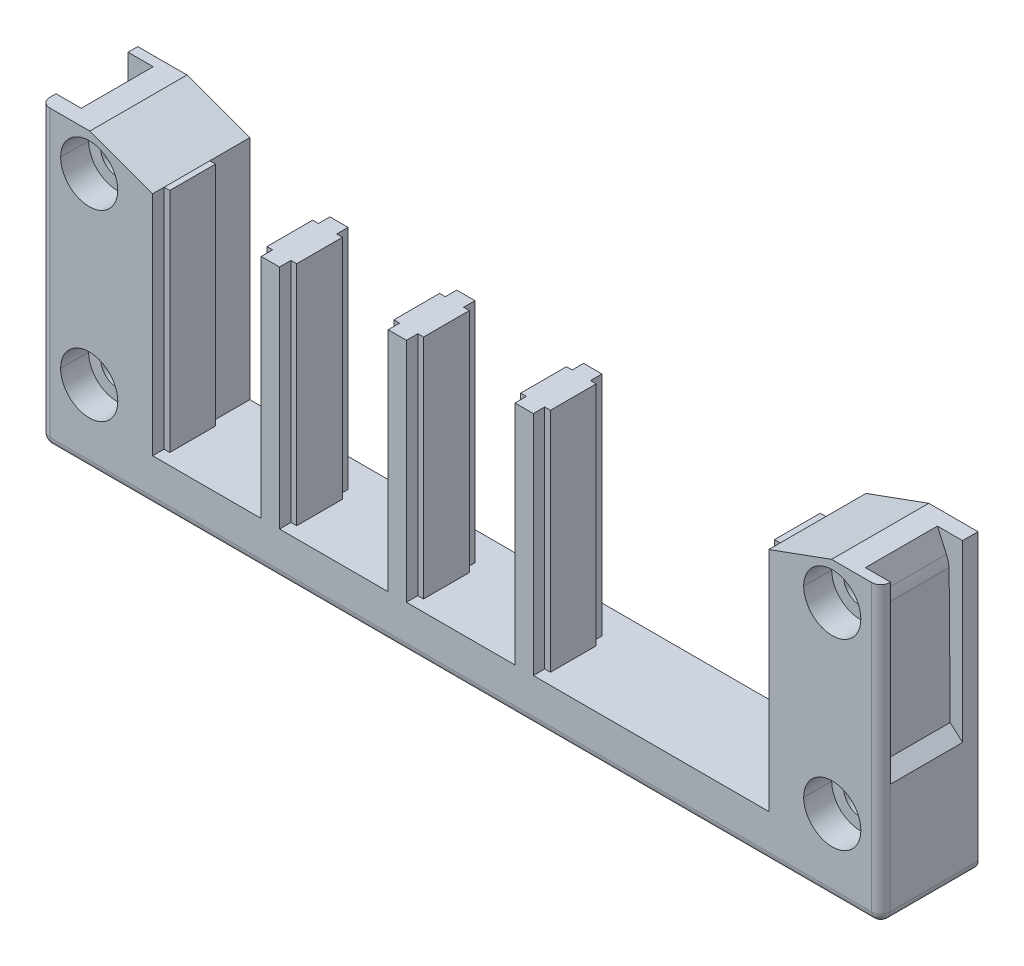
ISO-10303-21;
HEADER;
FILE_DESCRIPTION(('STEP AP214'),'2;1');
FILE_NAME('part.step','',(''),(''),'','','');
FILE_SCHEMA(('AUTOMOTIVE_DESIGN { 1 0 10303 214 1 1 1 1 }'));
ENDSEC;
DATA;
#1=APPLICATION_CONTEXT('core data for automotive mechanical design processes');
#2=APPLICATION_PROTOCOL_DEFINITION('international standard','automotive_design',2000,#1);
#3=PRODUCT_CONTEXT('',#1,'mechanical');
#4=PRODUCT('Part','Part','',(#3));
#5=PRODUCT_RELATED_PRODUCT_CATEGORY('part','',(#4));
#6=PRODUCT_DEFINITION_FORMATION('','',#4);
#7=PRODUCT_DEFINITION_CONTEXT('part definition',#1,'design');
#8=PRODUCT_DEFINITION('design','',#6,#7);
#9=PRODUCT_DEFINITION_SHAPE('','',#8);
#10=(LENGTH_UNIT() NAMED_UNIT(*) SI_UNIT(.MILLI.,.METRE.));
#11=(NAMED_UNIT(*) PLANE_ANGLE_UNIT() SI_UNIT($,.RADIAN.));
#12=(NAMED_UNIT(*) SI_UNIT($,.STERADIAN.) SOLID_ANGLE_UNIT());
#13=UNCERTAINTY_MEASURE_WITH_UNIT(LENGTH_MEASURE(1.E-05),#10,'distance_accuracy_value','');
#14=(GEOMETRIC_REPRESENTATION_CONTEXT(3) GLOBAL_UNCERTAINTY_ASSIGNED_CONTEXT((#13)) GLOBAL_UNIT_ASSIGNED_CONTEXT((#10,
#11,#12)) REPRESENTATION_CONTEXT('',''));
#15=CARTESIAN_POINT('',(0.,0.,0.));
#16=DIRECTION('',(0.,0.,1.));
#17=DIRECTION('',(1.,0.,0.));
#18=AXIS2_PLACEMENT_3D('',#15,#16,#17);
#19=CARTESIAN_POINT('',(53.9,-56.7782261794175,6.5));
#20=DIRECTION('',(0.,0.,-1.));
#21=DIRECTION('',(0.,-1.,0.));
#22=AXIS2_PLACEMENT_3D('',#19,#20,#21);
#23=PLANE('',#22);
#24=DIRECTION('',(0.,1.,0.));
#25=VECTOR('',#24,1.);
#26=CARTESIAN_POINT('',(52.9,-56.7782261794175,6.5));
#27=LINE('',#26,#25);
#28=CARTESIAN_POINT('',(52.8999999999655,-43.7,6.5));
#29=VERTEX_POINT('',#28);
#30=CARTESIAN_POINT('',(52.9,-4.,6.5));
#31=VERTEX_POINT('',#30);
#32=EDGE_CURVE('E10',#29,#31,#27,.T.);
#33=ORIENTED_EDGE('',*,*,#32,.F.);
#34=DIRECTION('',(1.,0.,0.));
#35=VECTOR('',#34,1.);
#36=CARTESIAN_POINT('',(53.9,-43.7,6.5));
#37=LINE('',#36,#35);
#38=CARTESIAN_POINT('',(53.8999999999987,-43.7,6.5));
#39=VERTEX_POINT('',#38);
#40=EDGE_CURVE('E1210',#29,#39,#37,.T.);
#41=ORIENTED_EDGE('',*,*,#40,.T.);
#42=DIRECTION('',(0.,1.,0.));
#43=VECTOR('',#42,1.);
#44=CARTESIAN_POINT('',(53.9,-56.7782261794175,6.5));
#45=LINE('',#44,#43);
#46=CARTESIAN_POINT('',(53.9,-4.,6.5));
#47=VERTEX_POINT('',#46);
#48=EDGE_CURVE('E765',#39,#47,#45,.T.);
#49=ORIENTED_EDGE('',*,*,#48,.T.);
#50=DIRECTION('',(-1.,0.,0.));
#51=VECTOR('',#50,1.);
#52=CARTESIAN_POINT('',(53.9,-4.,6.5));
#53=LINE('',#52,#51);
#54=EDGE_CURVE('E1284',#47,#31,#53,.T.);
#55=ORIENTED_EDGE('',*,*,#54,.T.);
#56=EDGE_LOOP('',(#33,#41,#49,#55));
#57=FACE_BOUND('',#56,.T.);
#58=ADVANCED_FACE('F15',(#57),#23,.F.);
#59=CARTESIAN_POINT('',(52.9,-56.7782261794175,6.5));
#60=DIRECTION('',(1.,0.,0.));
#61=DIRECTION('',(0.,1.,0.));
#62=AXIS2_PLACEMENT_3D('',#59,#60,#61);
#63=PLANE('',#62);
#64=DIRECTION('',(0.,1.,0.));
#65=VECTOR('',#64,1.);
#66=CARTESIAN_POINT('',(52.9,-56.7782261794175,-1.5));
#67=LINE('',#66,#65);
#68=CARTESIAN_POINT('',(52.9000000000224,-43.7,-1.5));
#69=VERTEX_POINT('',#68);
#70=CARTESIAN_POINT('',(52.9,-4.,-1.5));
#71=VERTEX_POINT('',#70);
#72=EDGE_CURVE('E18',#69,#71,#67,.T.);
#73=ORIENTED_EDGE('',*,*,#72,.F.);
#74=DIRECTION('',(0.,0.,1.));
#75=VECTOR('',#74,1.);
#76=CARTESIAN_POINT('',(52.9,-43.7,6.5));
#77=LINE('',#76,#75);
#78=EDGE_CURVE('E1214',#69,#29,#77,.T.);
#79=ORIENTED_EDGE('',*,*,#78,.T.);
#80=ORIENTED_EDGE('',*,*,#32,.T.);
#81=DIRECTION('',(0.,0.,-1.));
#82=VECTOR('',#81,1.);
#83=CARTESIAN_POINT('',(52.9,-4.,6.5));
#84=LINE('',#83,#82);
#85=EDGE_CURVE('E1679',#31,#71,#84,.T.);
#86=ORIENTED_EDGE('',*,*,#85,.T.);
#87=EDGE_LOOP('',(#73,#79,#80,#86));
#88=FACE_BOUND('',#87,.T.);
#89=ADVANCED_FACE('F2629',(#88),#63,.F.);
#90=CARTESIAN_POINT('',(53.9,-56.7782261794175,-1.5));
#91=DIRECTION('',(0.,0.,1.));
#92=DIRECTION('',(1.,0.,0.));
#93=AXIS2_PLACEMENT_3D('',#90,#91,#92);
#94=PLANE('',#93);
#95=DIRECTION('',(0.,1.,0.));
#96=VECTOR('',#95,1.);
#97=CARTESIAN_POINT('',(53.9,-56.7782261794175,-1.5));
#98=LINE('',#97,#96);
#99=CARTESIAN_POINT('',(53.8999999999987,-43.7,-1.5));
#100=VERTEX_POINT('',#99);
#101=CARTESIAN_POINT('',(53.9,-4.,-1.5));
#102=VERTEX_POINT('',#101);
#103=EDGE_CURVE('E1040',#100,#102,#98,.T.);
#104=ORIENTED_EDGE('',*,*,#103,.F.);
#105=DIRECTION('',(-1.,0.,0.));
#106=VECTOR('',#105,1.);
#107=CARTESIAN_POINT('',(53.9,-43.7,-1.5));
#108=LINE('',#107,#106);
#109=EDGE_CURVE('E1044',#100,#69,#108,.T.);
#110=ORIENTED_EDGE('',*,*,#109,.T.);
#111=ORIENTED_EDGE('',*,*,#72,.T.);
#112=DIRECTION('',(1.,0.,0.));
#113=VECTOR('',#112,1.);
#114=CARTESIAN_POINT('',(53.9,-4.,-1.5));
#115=LINE('',#114,#113);
#116=EDGE_CURVE('E1288',#71,#102,#115,.T.);
#117=ORIENTED_EDGE('',*,*,#116,.T.);
#118=EDGE_LOOP('',(#104,#110,#111,#117));
#119=FACE_BOUND('',#118,.T.);
#120=ADVANCED_FACE('F2619',(#119),#94,.F.);
#121=CARTESIAN_POINT('',(0.,-4.,0.));
#122=DIRECTION('',(0.,-1.,0.));
#123=DIRECTION('',(0.,0.,-1.));
#124=AXIS2_PLACEMENT_3D('',#121,#122,#123);
#125=PLANE('',#124);
#126=ORIENTED_EDGE('',*,*,#54,.F.);
#127=DIRECTION('',(0.,0.,1.));
#128=VECTOR('',#127,1.);
#129=CARTESIAN_POINT('',(53.9,-4.,6.5));
#130=LINE('',#129,#128);
#131=EDGE_CURVE('E1372',#102,#47,#130,.T.);
#132=ORIENTED_EDGE('',*,*,#131,.F.);
#133=ORIENTED_EDGE('',*,*,#116,.F.);
#134=ORIENTED_EDGE('',*,*,#85,.F.);
#135=EDGE_LOOP('',(#126,#132,#133,#134));
#136=FACE_BOUND('',#135,.T.);
#137=ADVANCED_FACE('F2609',(#136),#125,.F.);
#138=CARTESIAN_POINT('',(-53.9000000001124,-56.7782261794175,-1.5));
#139=DIRECTION('',(0.,0.,1.));
#140=DIRECTION('',(1.,0.,0.));
#141=AXIS2_PLACEMENT_3D('',#138,#139,#140);
#142=PLANE('',#141);
#143=DIRECTION('',(0.,1.,0.));
#144=VECTOR('',#143,1.);
#145=CARTESIAN_POINT('',(-52.9000000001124,-56.7782261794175,-1.5));
#146=LINE('',#145,#144);
#147=CARTESIAN_POINT('',(-52.9000000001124,-43.7,-1.5));
#148=VERTEX_POINT('',#147);
#149=CARTESIAN_POINT('',(-52.9000000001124,-4.,-1.5));
#150=VERTEX_POINT('',#149);
#151=EDGE_CURVE('E1289',#148,#150,#146,.T.);
#152=ORIENTED_EDGE('',*,*,#151,.F.);
#153=DIRECTION('',(-1.,0.,0.));
#154=VECTOR('',#153,1.);
#155=CARTESIAN_POINT('',(-53.9000000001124,-43.7,-1.5));
#156=LINE('',#155,#154);
#157=CARTESIAN_POINT('',(-53.9000000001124,-43.7,-1.5));
#158=VERTEX_POINT('',#157);
#159=EDGE_CURVE('E1129',#148,#158,#156,.T.);
#160=ORIENTED_EDGE('',*,*,#159,.T.);
#161=DIRECTION('',(0.,1.,0.));
#162=VECTOR('',#161,1.);
#163=CARTESIAN_POINT('',(-53.9000000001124,-56.7782261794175,-1.5));
#164=LINE('',#163,#162);
#165=CARTESIAN_POINT('',(-53.9,-4.,-1.5));
#166=VERTEX_POINT('',#165);
#167=EDGE_CURVE('E879',#158,#166,#164,.T.);
#168=ORIENTED_EDGE('',*,*,#167,.T.);
#169=DIRECTION('',(1.,0.,0.));
#170=VECTOR('',#169,1.);
#171=CARTESIAN_POINT('',(-53.9000000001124,-4.,-1.5));
#172=LINE('',#171,#170);
#173=EDGE_CURVE('E773',#166,#150,#172,.T.);
#174=ORIENTED_EDGE('',*,*,#173,.T.);
#175=EDGE_LOOP('',(#152,#160,#168,#174));
#176=FACE_BOUND('',#175,.T.);
#177=ADVANCED_FACE('F2322',(#176),#142,.F.);
#178=CARTESIAN_POINT('',(-52.9000000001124,-56.7782261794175,-1.5));
#179=DIRECTION('',(-1.,0.,0.));
#180=DIRECTION('',(0.,0.,1.));
#181=AXIS2_PLACEMENT_3D('',#178,#179,#180);
#182=PLANE('',#181);
#183=DIRECTION('',(0.,1.,0.));
#184=VECTOR('',#183,1.);
#185=CARTESIAN_POINT('',(-52.9000000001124,-56.7782261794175,6.5));
#186=LINE('',#185,#184);
#187=CARTESIAN_POINT('',(-52.9000000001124,-43.7,6.5));
#188=VERTEX_POINT('',#187);
#189=CARTESIAN_POINT('',(-52.9000000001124,-4.,6.5));
#190=VERTEX_POINT('',#189);
#191=EDGE_CURVE('E1609',#188,#190,#186,.T.);
#192=ORIENTED_EDGE('',*,*,#191,.F.);
#193=DIRECTION('',(0.,0.,-1.));
#194=VECTOR('',#193,1.);
#195=CARTESIAN_POINT('',(-52.9000000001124,-43.7,-1.5));
#196=LINE('',#195,#194);
#197=EDGE_CURVE('E1133',#188,#148,#196,.T.);
#198=ORIENTED_EDGE('',*,*,#197,.T.);
#199=ORIENTED_EDGE('',*,*,#151,.T.);
#200=DIRECTION('',(0.,0.,1.));
#201=VECTOR('',#200,1.);
#202=CARTESIAN_POINT('',(-52.9000000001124,-4.,-1.5));
#203=LINE('',#202,#201);
#204=EDGE_CURVE('E1605',#150,#190,#203,.T.);
#205=ORIENTED_EDGE('',*,*,#204,.T.);
#206=EDGE_LOOP('',(#192,#198,#199,#205));
#207=FACE_BOUND('',#206,.T.);
#208=ADVANCED_FACE('F2316',(#207),#182,.F.);
#209=CARTESIAN_POINT('',(-53.9000000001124,-56.7782261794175,6.5));
#210=DIRECTION('',(0.,0.,-1.));
#211=DIRECTION('',(0.,-1.,0.));
#212=AXIS2_PLACEMENT_3D('',#209,#210,#211);
#213=PLANE('',#212);
#214=DIRECTION('',(0.,1.,0.));
#215=VECTOR('',#214,1.);
#216=CARTESIAN_POINT('',(-53.9000000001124,-56.7782261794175,6.5));
#217=LINE('',#216,#215);
#218=CARTESIAN_POINT('',(-53.9000000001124,-43.7,6.5));
#219=VERTEX_POINT('',#218);
#220=CARTESIAN_POINT('',(-53.9000000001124,-4.,6.5));
#221=VERTEX_POINT('',#220);
#222=EDGE_CURVE('E880',#219,#221,#217,.T.);
#223=ORIENTED_EDGE('',*,*,#222,.F.);
#224=DIRECTION('',(1.,0.,0.));
#225=VECTOR('',#224,1.);
#226=CARTESIAN_POINT('',(-53.9000000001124,-43.7,6.5));
#227=LINE('',#226,#225);
#228=EDGE_CURVE('E807',#219,#188,#227,.T.);
#229=ORIENTED_EDGE('',*,*,#228,.T.);
#230=ORIENTED_EDGE('',*,*,#191,.T.);
#231=DIRECTION('',(-1.,0.,0.));
#232=VECTOR('',#231,1.);
#233=CARTESIAN_POINT('',(-53.9000000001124,-4.,6.5));
#234=LINE('',#233,#232);
#235=EDGE_CURVE('E777',#190,#221,#234,.T.);
#236=ORIENTED_EDGE('',*,*,#235,.T.);
#237=EDGE_LOOP('',(#223,#229,#230,#236));
#238=FACE_BOUND('',#237,.T.);
#239=ADVANCED_FACE('F2321',(#238),#213,.F.);
#240=CARTESIAN_POINT('',(0.,-4.,0.));
#241=DIRECTION('',(0.,-1.,0.));
#242=DIRECTION('',(0.,0.,-1.));
#243=AXIS2_PLACEMENT_3D('',#240,#241,#242);
#244=PLANE('',#243);
#245=ORIENTED_EDGE('',*,*,#173,.F.);
#246=DIRECTION('',(0.,0.,-1.));
#247=VECTOR('',#246,1.);
#248=CARTESIAN_POINT('',(-53.9000000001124,-4.,-1.5));
#249=LINE('',#248,#247);
#250=EDGE_CURVE('E1316',#221,#166,#249,.T.);
#251=ORIENTED_EDGE('',*,*,#250,.F.);
#252=ORIENTED_EDGE('',*,*,#235,.F.);
#253=ORIENTED_EDGE('',*,*,#204,.F.);
#254=EDGE_LOOP('',(#245,#251,#252,#253));
#255=FACE_BOUND('',#254,.T.);
#256=ADVANCED_FACE('F2343',(#255),#244,.F.);
#257=CARTESIAN_POINT('',(9.5,-56.7782261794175,8.5));
#258=DIRECTION('',(1.,0.,0.));
#259=DIRECTION('',(0.,1.,0.));
#260=AXIS2_PLACEMENT_3D('',#257,#258,#259);
#261=PLANE('',#260);
#262=DIRECTION('',(0.,1.,0.));
#263=VECTOR('',#262,1.);
#264=CARTESIAN_POINT('',(9.5,-56.7782261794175,6.5));
#265=LINE('',#264,#263);
#266=CARTESIAN_POINT('',(9.50000000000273,-43.7,6.5));
#267=VERTEX_POINT('',#266);
#268=CARTESIAN_POINT('',(9.5,-4.,6.5));
#269=VERTEX_POINT('',#268);
#270=EDGE_CURVE('E778',#267,#269,#265,.T.);
#271=ORIENTED_EDGE('',*,*,#270,.F.);
#272=DIRECTION('',(0.,0.,1.));
#273=VECTOR('',#272,1.);
#274=CARTESIAN_POINT('',(9.5,-43.7,8.5));
#275=LINE('',#274,#273);
#276=CARTESIAN_POINT('',(9.49999999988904,-43.7,8.5));
#277=VERTEX_POINT('',#276);
#278=EDGE_CURVE('E1100',#267,#277,#275,.T.);
#279=ORIENTED_EDGE('',*,*,#278,.T.);
#280=DIRECTION('',(0.,1.,0.));
#281=VECTOR('',#280,1.);
#282=CARTESIAN_POINT('',(9.5,-56.7782261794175,8.5));
#283=LINE('',#282,#281);
#284=CARTESIAN_POINT('',(9.5,-4.,8.5));
#285=VERTEX_POINT('',#284);
#286=EDGE_CURVE('E1039',#277,#285,#283,.T.);
#287=ORIENTED_EDGE('',*,*,#286,.T.);
#288=DIRECTION('',(0.,0.,-1.));
#289=VECTOR('',#288,1.);
#290=CARTESIAN_POINT('',(9.5,-4.,8.5));
#291=LINE('',#290,#289);
#292=EDGE_CURVE('E1458',#285,#269,#291,.T.);
#293=ORIENTED_EDGE('',*,*,#292,.T.);
#294=EDGE_LOOP('',(#271,#279,#287,#293));
#295=FACE_BOUND('',#294,.T.);
#296=ADVANCED_FACE('F2180',(#295),#261,.F.);
#297=CARTESIAN_POINT('',(8.5,-56.7782261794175,6.5));
#298=DIRECTION('',(0.,0.,-1.));
#299=DIRECTION('',(0.,-1.,0.));
#300=AXIS2_PLACEMENT_3D('',#297,#298,#299);
#301=PLANE('',#300);
#302=DIRECTION('',(0.,1.,0.));
#303=VECTOR('',#302,1.);
#304=CARTESIAN_POINT('',(8.5,-56.7782261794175,6.5));
#305=LINE('',#304,#303);
#306=CARTESIAN_POINT('',(8.49999999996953,-43.7,6.5));
#307=VERTEX_POINT('',#306);
#308=CARTESIAN_POINT('',(8.5,-4.,6.5));
#309=VERTEX_POINT('',#308);
#310=EDGE_CURVE('E1667',#307,#309,#305,.T.);
#311=ORIENTED_EDGE('',*,*,#310,.F.);
#312=DIRECTION('',(1.,0.,0.));
#313=VECTOR('',#312,1.);
#314=CARTESIAN_POINT('',(8.5,-43.7,6.5));
#315=LINE('',#314,#313);
#316=EDGE_CURVE('E1103',#307,#267,#315,.T.);
#317=ORIENTED_EDGE('',*,*,#316,.T.);
#318=ORIENTED_EDGE('',*,*,#270,.T.);
#319=DIRECTION('',(-1.,0.,0.));
#320=VECTOR('',#319,1.);
#321=CARTESIAN_POINT('',(8.5,-4.,6.5));
#322=LINE('',#321,#320);
#323=EDGE_CURVE('E1463',#269,#309,#322,.T.);
#324=ORIENTED_EDGE('',*,*,#323,.T.);
#325=EDGE_LOOP('',(#311,#317,#318,#324));
#326=FACE_BOUND('',#325,.T.);
#327=ADVANCED_FACE('F2174',(#326),#301,.F.);
#328=CARTESIAN_POINT('',(8.5,-56.7782261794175,-1.5));
#329=DIRECTION('',(1.,0.,0.));
#330=DIRECTION('',(0.,1.,0.));
#331=AXIS2_PLACEMENT_3D('',#328,#329,#330);
#332=PLANE('',#331);
#333=DIRECTION('',(0.,1.,0.));
#334=VECTOR('',#333,1.);
#335=CARTESIAN_POINT('',(8.5,-56.7782261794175,-1.5));
#336=LINE('',#335,#334);
#337=CARTESIAN_POINT('',(8.50000000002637,-43.7,-1.5));
#338=VERTEX_POINT('',#337);
#339=CARTESIAN_POINT('',(8.5,-4.,-1.5));
#340=VERTEX_POINT('',#339);
#341=EDGE_CURVE('E1664',#338,#340,#336,.T.);
#342=ORIENTED_EDGE('',*,*,#341,.F.);
#343=DIRECTION('',(0.,0.,1.));
#344=VECTOR('',#343,1.);
#345=CARTESIAN_POINT('',(8.5,-43.7,-1.5));
#346=LINE('',#345,#344);
#347=EDGE_CURVE('E975',#338,#307,#346,.T.);
#348=ORIENTED_EDGE('',*,*,#347,.T.);
#349=ORIENTED_EDGE('',*,*,#310,.T.);
#350=DIRECTION('',(0.,0.,-1.));
#351=VECTOR('',#350,1.);
#352=CARTESIAN_POINT('',(8.5,-4.,-1.5));
#353=LINE('',#352,#351);
#354=EDGE_CURVE('E1617',#309,#340,#353,.T.);
#355=ORIENTED_EDGE('',*,*,#354,.T.);
#356=EDGE_LOOP('',(#342,#348,#349,#355));
#357=FACE_BOUND('',#356,.T.);
#358=ADVANCED_FACE('F2179',(#357),#332,.F.);
#359=CARTESIAN_POINT('',(9.5,-56.7782261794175,-1.5));
#360=DIRECTION('',(0.,0.,1.));
#361=DIRECTION('',(1.,0.,0.));
#362=AXIS2_PLACEMENT_3D('',#359,#360,#361);
#363=PLANE('',#362);
#364=DIRECTION('',(0.,1.,0.));
#365=VECTOR('',#364,1.);
#366=CARTESIAN_POINT('',(9.5,-56.7782261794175,-1.5));
#367=LINE('',#366,#365);
#368=CARTESIAN_POINT('',(9.50000000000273,-43.7,-1.5));
#369=VERTEX_POINT('',#368);
#370=CARTESIAN_POINT('',(9.5,-4.,-1.5));
#371=VERTEX_POINT('',#370);
#372=EDGE_CURVE('E1263',#369,#371,#367,.T.);
#373=ORIENTED_EDGE('',*,*,#372,.F.);
#374=DIRECTION('',(-1.,0.,0.));
#375=VECTOR('',#374,1.);
#376=CARTESIAN_POINT('',(9.5,-43.7,-1.5));
#377=LINE('',#376,#375);
#378=EDGE_CURVE('E970',#369,#338,#377,.T.);
#379=ORIENTED_EDGE('',*,*,#378,.T.);
#380=ORIENTED_EDGE('',*,*,#341,.T.);
#381=DIRECTION('',(1.,0.,0.));
#382=VECTOR('',#381,1.);
#383=CARTESIAN_POINT('',(9.5,-4.,-1.5));
#384=LINE('',#383,#382);
#385=EDGE_CURVE('E1613',#340,#371,#384,.T.);
#386=ORIENTED_EDGE('',*,*,#385,.T.);
#387=EDGE_LOOP('',(#373,#379,#380,#386));
#388=FACE_BOUND('',#387,.T.);
#389=ADVANCED_FACE('F2583',(#388),#363,.F.);
#390=CARTESIAN_POINT('',(9.5,-56.7782261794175,-3.5));
#391=DIRECTION('',(1.,0.,0.));
#392=DIRECTION('',(0.,1.,0.));
#393=AXIS2_PLACEMENT_3D('',#390,#391,#392);
#394=PLANE('',#393);
#395=DIRECTION('',(0.,1.,0.));
#396=VECTOR('',#395,1.);
#397=CARTESIAN_POINT('',(9.5,-56.7782261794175,-3.5));
#398=LINE('',#397,#396);
#399=CARTESIAN_POINT('',(9.50000000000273,-43.7,-3.5));
#400=VERTEX_POINT('',#399);
#401=CARTESIAN_POINT('',(9.5,-4.,-3.5));
#402=VERTEX_POINT('',#401);
#403=EDGE_CURVE('E1260',#400,#402,#398,.T.);
#404=ORIENTED_EDGE('',*,*,#403,.F.);
#405=DIRECTION('',(0.,0.,1.));
#406=VECTOR('',#405,1.);
#407=CARTESIAN_POINT('',(9.5,-43.7,-3.5));
#408=LINE('',#407,#406);
#409=EDGE_CURVE('E974',#400,#369,#408,.T.);
#410=ORIENTED_EDGE('',*,*,#409,.T.);
#411=ORIENTED_EDGE('',*,*,#372,.T.);
#412=DIRECTION('',(0.,0.,-1.));
#413=VECTOR('',#412,1.);
#414=CARTESIAN_POINT('',(9.5,-4.,-3.5));
#415=LINE('',#414,#413);
#416=EDGE_CURVE('E1256',#371,#402,#415,.T.);
#417=ORIENTED_EDGE('',*,*,#416,.T.);
#418=EDGE_LOOP('',(#404,#410,#411,#417));
#419=FACE_BOUND('',#418,.T.);
#420=ADVANCED_FACE('F1739',(#419),#394,.F.);
#421=CARTESIAN_POINT('',(12.7,-56.7782261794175,-3.5));
#422=DIRECTION('',(0.,0.,1.));
#423=DIRECTION('',(1.,0.,0.));
#424=AXIS2_PLACEMENT_3D('',#421,#422,#423);
#425=PLANE('',#424);
#426=DIRECTION('',(0.,1.,0.));
#427=VECTOR('',#426,1.);
#428=CARTESIAN_POINT('',(12.7,-56.7782261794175,-3.5));
#429=LINE('',#428,#427);
#430=CARTESIAN_POINT('',(12.6999999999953,-43.7,-3.5));
#431=VERTEX_POINT('',#430);
#432=CARTESIAN_POINT('',(12.7,-4.,-3.5));
#433=VERTEX_POINT('',#432);
#434=EDGE_CURVE('E1264',#431,#433,#429,.T.);
#435=ORIENTED_EDGE('',*,*,#434,.F.);
#436=DIRECTION('',(-1.,0.,0.));
#437=VECTOR('',#436,1.);
#438=CARTESIAN_POINT('',(12.7,-43.7,-3.5));
#439=LINE('',#438,#437);
#440=EDGE_CURVE('E988',#431,#400,#439,.T.);
#441=ORIENTED_EDGE('',*,*,#440,.T.);
#442=ORIENTED_EDGE('',*,*,#403,.T.);
#443=DIRECTION('',(1.,0.,0.));
#444=VECTOR('',#443,1.);
#445=CARTESIAN_POINT('',(12.7,-4.,-3.5));
#446=LINE('',#445,#444);
#447=EDGE_CURVE('E893',#402,#433,#446,.T.);
#448=ORIENTED_EDGE('',*,*,#447,.T.);
#449=EDGE_LOOP('',(#435,#441,#442,#448));
#450=FACE_BOUND('',#449,.T.);
#451=ADVANCED_FACE('F1733',(#450),#425,.F.);
#452=CARTESIAN_POINT('',(12.7,-56.7782261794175,-1.5));
#453=DIRECTION('',(-1.,0.,0.));
#454=DIRECTION('',(0.,0.,1.));
#455=AXIS2_PLACEMENT_3D('',#452,#453,#454);
#456=PLANE('',#455);
#457=DIRECTION('',(0.,1.,0.));
#458=VECTOR('',#457,1.);
#459=CARTESIAN_POINT('',(12.7,-56.7782261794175,-1.5));
#460=LINE('',#459,#458);
#461=CARTESIAN_POINT('',(12.6999999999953,-43.7,-1.5));
#462=VERTEX_POINT('',#461);
#463=CARTESIAN_POINT('',(12.7,-4.,-1.5));
#464=VERTEX_POINT('',#463);
#465=EDGE_CURVE('E1657',#462,#464,#460,.T.);
#466=ORIENTED_EDGE('',*,*,#465,.F.);
#467=DIRECTION('',(0.,0.,-1.));
#468=VECTOR('',#467,1.);
#469=CARTESIAN_POINT('',(12.7,-43.7,-1.5));
#470=LINE('',#469,#468);
#471=EDGE_CURVE('E1066',#462,#431,#470,.T.);
#472=ORIENTED_EDGE('',*,*,#471,.T.);
#473=ORIENTED_EDGE('',*,*,#434,.T.);
#474=DIRECTION('',(0.,0.,1.));
#475=VECTOR('',#474,1.);
#476=CARTESIAN_POINT('',(12.7,-4.,-1.5));
#477=LINE('',#476,#475);
#478=EDGE_CURVE('E889',#433,#464,#477,.T.);
#479=ORIENTED_EDGE('',*,*,#478,.T.);
#480=EDGE_LOOP('',(#466,#472,#473,#479));
#481=FACE_BOUND('',#480,.T.);
#482=ADVANCED_FACE('F1738',(#481),#456,.F.);
#483=CARTESIAN_POINT('',(13.7,-56.7782261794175,-1.5));
#484=DIRECTION('',(0.,0.,1.));
#485=DIRECTION('',(1.,0.,0.));
#486=AXIS2_PLACEMENT_3D('',#483,#484,#485);
#487=PLANE('',#486);
#488=DIRECTION('',(0.,1.,0.));
#489=VECTOR('',#488,1.);
#490=CARTESIAN_POINT('',(13.7,-56.7782261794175,-1.5));
#491=LINE('',#490,#489);
#492=CARTESIAN_POINT('',(13.7000000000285,-43.7,-1.5));
#493=VERTEX_POINT('',#492);
#494=CARTESIAN_POINT('',(13.7,-4.,-1.5));
#495=VERTEX_POINT('',#494);
#496=EDGE_CURVE('E1654',#493,#495,#491,.T.);
#497=ORIENTED_EDGE('',*,*,#496,.F.);
#498=DIRECTION('',(-1.,0.,0.));
#499=VECTOR('',#498,1.);
#500=CARTESIAN_POINT('',(13.7,-43.7,-1.5));
#501=LINE('',#500,#499);
#502=EDGE_CURVE('E760',#493,#462,#501,.T.);
#503=ORIENTED_EDGE('',*,*,#502,.T.);
#504=ORIENTED_EDGE('',*,*,#465,.T.);
#505=DIRECTION('',(1.,0.,0.));
#506=VECTOR('',#505,1.);
#507=CARTESIAN_POINT('',(13.7,-4.,-1.5));
#508=LINE('',#507,#506);
#509=EDGE_CURVE('E894',#464,#495,#508,.T.);
#510=ORIENTED_EDGE('',*,*,#509,.T.);
#511=EDGE_LOOP('',(#497,#503,#504,#510));
#512=FACE_BOUND('',#511,.T.);
#513=ADVANCED_FACE('F1976',(#512),#487,.F.);
#514=CARTESIAN_POINT('',(13.7,-56.7782261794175,6.5));
#515=DIRECTION('',(-1.,0.,0.));
#516=DIRECTION('',(0.,0.,1.));
#517=AXIS2_PLACEMENT_3D('',#514,#515,#516);
#518=PLANE('',#517);
#519=DIRECTION('',(0.,1.,0.));
#520=VECTOR('',#519,1.);
#521=CARTESIAN_POINT('',(13.7,-56.7782261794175,6.5));
#522=LINE('',#521,#520);
#523=CARTESIAN_POINT('',(13.6999999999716,-43.7,6.5));
#524=VERTEX_POINT('',#523);
#525=CARTESIAN_POINT('',(13.7,-4.,6.5));
#526=VERTEX_POINT('',#525);
#527=EDGE_CURVE('E1651',#524,#526,#522,.T.);
#528=ORIENTED_EDGE('',*,*,#527,.F.);
#529=DIRECTION('',(0.,0.,-1.));
#530=VECTOR('',#529,1.);
#531=CARTESIAN_POINT('',(13.7,-43.7,6.5));
#532=LINE('',#531,#530);
#533=EDGE_CURVE('E757',#524,#493,#532,.T.);
#534=ORIENTED_EDGE('',*,*,#533,.T.);
#535=ORIENTED_EDGE('',*,*,#496,.T.);
#536=DIRECTION('',(0.,0.,1.));
#537=VECTOR('',#536,1.);
#538=CARTESIAN_POINT('',(13.7,-4.,6.5));
#539=LINE('',#538,#537);
#540=EDGE_CURVE('E1633',#495,#526,#539,.T.);
#541=ORIENTED_EDGE('',*,*,#540,.T.);
#542=EDGE_LOOP('',(#528,#534,#535,#541));
#543=FACE_BOUND('',#542,.T.);
#544=ADVANCED_FACE('F2557',(#543),#518,.F.);
#545=CARTESIAN_POINT('',(12.7,-56.7782261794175,6.5));
#546=DIRECTION('',(0.,0.,-1.));
#547=DIRECTION('',(0.,-1.,0.));
#548=AXIS2_PLACEMENT_3D('',#545,#546,#547);
#549=PLANE('',#548);
#550=DIRECTION('',(0.,1.,0.));
#551=VECTOR('',#550,1.);
#552=CARTESIAN_POINT('',(12.7,-56.7782261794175,6.5));
#553=LINE('',#552,#551);
#554=CARTESIAN_POINT('',(12.6999999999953,-43.7,6.5));
#555=VERTEX_POINT('',#554);
#556=CARTESIAN_POINT('',(12.7,-4.,6.5));
#557=VERTEX_POINT('',#556);
#558=EDGE_CURVE('E1462',#555,#557,#553,.T.);
#559=ORIENTED_EDGE('',*,*,#558,.F.);
#560=DIRECTION('',(1.,0.,0.));
#561=VECTOR('',#560,1.);
#562=CARTESIAN_POINT('',(12.7,-43.7,6.5));
#563=LINE('',#562,#561);
#564=EDGE_CURVE('E759',#555,#524,#563,.T.);
#565=ORIENTED_EDGE('',*,*,#564,.T.);
#566=ORIENTED_EDGE('',*,*,#527,.T.);
#567=DIRECTION('',(-1.,0.,0.));
#568=VECTOR('',#567,1.);
#569=CARTESIAN_POINT('',(12.7,-4.,6.5));
#570=LINE('',#569,#568);
#571=EDGE_CURVE('E1629',#526,#557,#570,.T.);
#572=ORIENTED_EDGE('',*,*,#571,.T.);
#573=EDGE_LOOP('',(#559,#565,#566,#572));
#574=FACE_BOUND('',#573,.T.);
#575=ADVANCED_FACE('F2547',(#574),#549,.F.);
#576=CARTESIAN_POINT('',(12.7,-56.7782261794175,8.5));
#577=DIRECTION('',(-1.,0.,0.));
#578=DIRECTION('',(0.,0.,1.));
#579=AXIS2_PLACEMENT_3D('',#576,#577,#578);
#580=PLANE('',#579);
#581=DIRECTION('',(0.,1.,0.));
#582=VECTOR('',#581,1.);
#583=CARTESIAN_POINT('',(12.7,-56.7782261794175,8.5));
#584=LINE('',#583,#582);
#585=CARTESIAN_POINT('',(12.7,-43.7,8.5));
#586=VERTEX_POINT('',#585);
#587=CARTESIAN_POINT('',(12.7,-4.,8.5));
#588=VERTEX_POINT('',#587);
#589=EDGE_CURVE('E1031',#586,#588,#584,.T.);
#590=ORIENTED_EDGE('',*,*,#589,.F.);
#591=DIRECTION('',(0.,0.,-1.));
#592=VECTOR('',#591,1.);
#593=CARTESIAN_POINT('',(12.7,-43.7,8.5));
#594=LINE('',#593,#592);
#595=EDGE_CURVE('E788',#586,#555,#594,.T.);
#596=ORIENTED_EDGE('',*,*,#595,.T.);
#597=ORIENTED_EDGE('',*,*,#558,.T.);
#598=DIRECTION('',(0.,0.,1.));
#599=VECTOR('',#598,1.);
#600=CARTESIAN_POINT('',(12.7,-4.,8.5));
#601=LINE('',#600,#599);
#602=EDGE_CURVE('E1626',#557,#588,#601,.T.);
#603=ORIENTED_EDGE('',*,*,#602,.T.);
#604=EDGE_LOOP('',(#590,#596,#597,#603));
#605=FACE_BOUND('',#604,.T.);
#606=ADVANCED_FACE('F2537',(#605),#580,.F.);
#607=CARTESIAN_POINT('',(0.,-4.,0.));
#608=DIRECTION('',(0.,1.,0.));
#609=DIRECTION('',(1.,0.,0.));
#610=AXIS2_PLACEMENT_3D('',#607,#608,#609);
#611=PLANE('',#610);
#612=DIRECTION('',(-1.,0.,0.));
#613=VECTOR('',#612,1.);
#614=CARTESIAN_POINT('',(9.5,-4.,8.5));
#615=LINE('',#614,#613);
#616=EDGE_CURVE('E1035',#588,#285,#615,.T.);
#617=ORIENTED_EDGE('',*,*,#616,.F.);
#618=ORIENTED_EDGE('',*,*,#602,.F.);
#619=ORIENTED_EDGE('',*,*,#571,.F.);
#620=ORIENTED_EDGE('',*,*,#540,.F.);
#621=ORIENTED_EDGE('',*,*,#509,.F.);
#622=ORIENTED_EDGE('',*,*,#478,.F.);
#623=ORIENTED_EDGE('',*,*,#447,.F.);
#624=ORIENTED_EDGE('',*,*,#416,.F.);
#625=ORIENTED_EDGE('',*,*,#385,.F.);
#626=ORIENTED_EDGE('',*,*,#354,.F.);
#627=ORIENTED_EDGE('',*,*,#323,.F.);
#628=ORIENTED_EDGE('',*,*,#292,.F.);
#629=EDGE_LOOP('',(#617,#618,#619,#620,#621,#622,#623,#624,#625,#626,#627,#628));
#630=FACE_BOUND('',#629,.T.);
#631=ADVANCED_FACE('F2527',(#630),#611,.T.);
#632=CARTESIAN_POINT('',(-12.7,-56.7782261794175,8.5));
#633=DIRECTION('',(1.,0.,0.));
#634=DIRECTION('',(0.,0.,-1.));
#635=AXIS2_PLACEMENT_3D('',#632,#633,#634);
#636=PLANE('',#635);
#637=DIRECTION('',(0.,1.,0.));
#638=VECTOR('',#637,1.);
#639=CARTESIAN_POINT('',(-12.7,-56.7782261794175,6.5));
#640=LINE('',#639,#638);
#641=CARTESIAN_POINT('',(-12.6999999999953,-43.7,6.5));
#642=VERTEX_POINT('',#641);
#643=CARTESIAN_POINT('',(-12.7,-4.,6.5));
#644=VERTEX_POINT('',#643);
#645=EDGE_CURVE('E1623',#642,#644,#640,.T.);
#646=ORIENTED_EDGE('',*,*,#645,.F.);
#647=DIRECTION('',(0.,0.,1.));
#648=VECTOR('',#647,1.);
#649=CARTESIAN_POINT('',(-12.7,-43.7,8.5));
#650=LINE('',#649,#648);
#651=CARTESIAN_POINT('',(-12.700000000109,-43.7,8.5));
#652=VERTEX_POINT('',#651);
#653=EDGE_CURVE('E885',#642,#652,#650,.T.);
#654=ORIENTED_EDGE('',*,*,#653,.T.);
#655=DIRECTION('',(0.,1.,0.));
#656=VECTOR('',#655,1.);
#657=CARTESIAN_POINT('',(-12.7,-56.7782261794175,8.5));
#658=LINE('',#657,#656);
#659=CARTESIAN_POINT('',(-12.7,-4.,8.5));
#660=VERTEX_POINT('',#659);
#661=EDGE_CURVE('E794',#652,#660,#658,.T.);
#662=ORIENTED_EDGE('',*,*,#661,.T.);
#663=DIRECTION('',(0.,0.,-1.));
#664=VECTOR('',#663,1.);
#665=CARTESIAN_POINT('',(-12.7,-4.,8.5));
#666=LINE('',#665,#664);
#667=EDGE_CURVE('E1582',#660,#644,#666,.T.);
#668=ORIENTED_EDGE('',*,*,#667,.T.);
#669=EDGE_LOOP('',(#646,#654,#662,#668));
#670=FACE_BOUND('',#669,.T.);
#671=ADVANCED_FACE('F1841',(#670),#636,.F.);
#672=CARTESIAN_POINT('',(-13.7,-56.7782261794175,6.5));
#673=DIRECTION('',(0.,0.,-1.));
#674=DIRECTION('',(0.,-1.,0.));
#675=AXIS2_PLACEMENT_3D('',#672,#673,#674);
#676=PLANE('',#675);
#677=DIRECTION('',(0.,1.,0.));
#678=VECTOR('',#677,1.);
#679=CARTESIAN_POINT('',(-13.7,-56.7782261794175,6.5));
#680=LINE('',#679,#678);
#681=CARTESIAN_POINT('',(-13.7000000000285,-43.7,6.5));
#682=VERTEX_POINT('',#681);
#683=CARTESIAN_POINT('',(-13.7,-4.,6.5));
#684=VERTEX_POINT('',#683);
#685=EDGE_CURVE('E1620',#682,#684,#680,.T.);
#686=ORIENTED_EDGE('',*,*,#685,.F.);
#687=DIRECTION('',(1.,0.,0.));
#688=VECTOR('',#687,1.);
#689=CARTESIAN_POINT('',(-13.7,-43.7,6.5));
#690=LINE('',#689,#688);
#691=EDGE_CURVE('E888',#682,#642,#690,.T.);
#692=ORIENTED_EDGE('',*,*,#691,.T.);
#693=ORIENTED_EDGE('',*,*,#645,.T.);
#694=DIRECTION('',(-1.,0.,0.));
#695=VECTOR('',#694,1.);
#696=CARTESIAN_POINT('',(-13.7,-4.,6.5));
#697=LINE('',#696,#695);
#698=EDGE_CURVE('E1578',#644,#684,#697,.T.);
#699=ORIENTED_EDGE('',*,*,#698,.T.);
#700=EDGE_LOOP('',(#686,#692,#693,#699));
#701=FACE_BOUND('',#700,.T.);
#702=ADVANCED_FACE('F1835',(#701),#676,.F.);
#703=CARTESIAN_POINT('',(-13.7,-56.7782261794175,-1.5));
#704=DIRECTION('',(1.,0.,0.));
#705=DIRECTION('',(0.,0.,1.));
#706=AXIS2_PLACEMENT_3D('',#703,#704,#705);
#707=PLANE('',#706);
#708=DIRECTION('',(0.,1.,0.));
#709=VECTOR('',#708,1.);
#710=CARTESIAN_POINT('',(-13.7,-56.7782261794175,-1.5));
#711=LINE('',#710,#709);
#712=CARTESIAN_POINT('',(-13.6999999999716,-43.7,-1.5));
#713=VERTEX_POINT('',#712);
#714=CARTESIAN_POINT('',(-13.7,-4.,-1.5));
#715=VERTEX_POINT('',#714);
#716=EDGE_CURVE('E1612',#713,#715,#711,.T.);
#717=ORIENTED_EDGE('',*,*,#716,.F.);
#718=DIRECTION('',(0.,0.,1.));
#719=VECTOR('',#718,1.);
#720=CARTESIAN_POINT('',(-13.7,-43.7,-1.5));
#721=LINE('',#720,#719);
#722=EDGE_CURVE('E1170',#713,#682,#721,.T.);
#723=ORIENTED_EDGE('',*,*,#722,.T.);
#724=ORIENTED_EDGE('',*,*,#685,.T.);
#725=DIRECTION('',(0.,0.,-1.));
#726=VECTOR('',#725,1.);
#727=CARTESIAN_POINT('',(-13.7,-4.,-1.5));
#728=LINE('',#727,#726);
#729=EDGE_CURVE('E1574',#684,#715,#728,.T.);
#730=ORIENTED_EDGE('',*,*,#729,.T.);
#731=EDGE_LOOP('',(#717,#723,#724,#730));
#732=FACE_BOUND('',#731,.T.);
#733=ADVANCED_FACE('F1840',(#732),#707,.F.);
#734=CARTESIAN_POINT('',(-12.7,-56.7782261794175,-1.5));
#735=DIRECTION('',(0.,0.,1.));
#736=DIRECTION('',(1.,0.,0.));
#737=AXIS2_PLACEMENT_3D('',#734,#735,#736);
#738=PLANE('',#737);
#739=DIRECTION('',(0.,1.,0.));
#740=VECTOR('',#739,1.);
#741=CARTESIAN_POINT('',(-12.7,-56.7782261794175,-1.5));
#742=LINE('',#741,#740);
#743=CARTESIAN_POINT('',(-12.6999999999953,-43.7,-1.5));
#744=VERTEX_POINT('',#743);
#745=CARTESIAN_POINT('',(-12.7,-4.,-1.5));
#746=VERTEX_POINT('',#745);
#747=EDGE_CURVE('E1604',#744,#746,#742,.T.);
#748=ORIENTED_EDGE('',*,*,#747,.F.);
#749=DIRECTION('',(-1.,0.,0.));
#750=VECTOR('',#749,1.);
#751=CARTESIAN_POINT('',(-12.7,-43.7,-1.5));
#752=LINE('',#751,#750);
#753=EDGE_CURVE('E1174',#744,#713,#752,.T.);
#754=ORIENTED_EDGE('',*,*,#753,.T.);
#755=ORIENTED_EDGE('',*,*,#716,.T.);
#756=DIRECTION('',(1.,0.,0.));
#757=VECTOR('',#756,1.);
#758=CARTESIAN_POINT('',(-12.7,-4.,-1.5));
#759=LINE('',#758,#757);
#760=EDGE_CURVE('E1570',#715,#746,#759,.T.);
#761=ORIENTED_EDGE('',*,*,#760,.T.);
#762=EDGE_LOOP('',(#748,#754,#755,#761));
#763=FACE_BOUND('',#762,.T.);
#764=ADVANCED_FACE('F2063',(#763),#738,.F.);
#765=CARTESIAN_POINT('',(-12.7,-56.7782261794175,-3.5));
#766=DIRECTION('',(1.,0.,0.));
#767=DIRECTION('',(0.,1.,0.));
#768=AXIS2_PLACEMENT_3D('',#765,#766,#767);
#769=PLANE('',#768);
#770=DIRECTION('',(0.,1.,0.));
#771=VECTOR('',#770,1.);
#772=CARTESIAN_POINT('',(-12.7,-56.7782261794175,-3.5));
#773=LINE('',#772,#771);
#774=CARTESIAN_POINT('',(-12.6999999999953,-43.7,-3.5));
#775=VERTEX_POINT('',#774);
#776=CARTESIAN_POINT('',(-12.7,-4.,-3.5));
#777=VERTEX_POINT('',#776);
#778=EDGE_CURVE('E1601',#775,#777,#773,.T.);
#779=ORIENTED_EDGE('',*,*,#778,.F.);
#780=DIRECTION('',(0.,0.,1.));
#781=VECTOR('',#780,1.);
#782=CARTESIAN_POINT('',(-12.7,-43.7,-3.5));
#783=LINE('',#782,#781);
#784=EDGE_CURVE('E1178',#775,#744,#783,.T.);
#785=ORIENTED_EDGE('',*,*,#784,.T.);
#786=ORIENTED_EDGE('',*,*,#747,.T.);
#787=DIRECTION('',(0.,0.,-1.));
#788=VECTOR('',#787,1.);
#789=CARTESIAN_POINT('',(-12.7,-4.,-3.5));
#790=LINE('',#789,#788);
#791=EDGE_CURVE('E1566',#746,#777,#790,.T.);
#792=ORIENTED_EDGE('',*,*,#791,.T.);
#793=EDGE_LOOP('',(#779,#785,#786,#792));
#794=FACE_BOUND('',#793,.T.);
#795=ADVANCED_FACE('F2057',(#794),#769,.F.);
#796=CARTESIAN_POINT('',(-9.5,-56.7782261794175,-3.5));
#797=DIRECTION('',(0.,0.,1.));
#798=DIRECTION('',(1.,0.,0.));
#799=AXIS2_PLACEMENT_3D('',#796,#797,#798);
#800=PLANE('',#799);
#801=DIRECTION('',(0.,1.,0.));
#802=VECTOR('',#801,1.);
#803=CARTESIAN_POINT('',(-9.5,-56.7782261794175,-3.5));
#804=LINE('',#803,#802);
#805=CARTESIAN_POINT('',(-9.50000000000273,-43.7,-3.5));
#806=VERTEX_POINT('',#805);
#807=CARTESIAN_POINT('',(-9.5,-4.,-3.5));
#808=VERTEX_POINT('',#807);
#809=EDGE_CURVE('E1598',#806,#808,#804,.T.);
#810=ORIENTED_EDGE('',*,*,#809,.F.);
#811=DIRECTION('',(-1.,0.,0.));
#812=VECTOR('',#811,1.);
#813=CARTESIAN_POINT('',(-9.5,-43.7,-3.5));
#814=LINE('',#813,#812);
#815=EDGE_CURVE('E1182',#806,#775,#814,.T.);
#816=ORIENTED_EDGE('',*,*,#815,.T.);
#817=ORIENTED_EDGE('',*,*,#778,.T.);
#818=DIRECTION('',(1.,0.,0.));
#819=VECTOR('',#818,1.);
#820=CARTESIAN_POINT('',(-9.5,-4.,-3.5));
#821=LINE('',#820,#819);
#822=EDGE_CURVE('E755',#777,#808,#821,.T.);
#823=ORIENTED_EDGE('',*,*,#822,.T.);
#824=EDGE_LOOP('',(#810,#816,#817,#823));
#825=FACE_BOUND('',#824,.T.);
#826=ADVANCED_FACE('F2062',(#825),#800,.F.);
#827=CARTESIAN_POINT('',(-9.5,-56.7782261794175,-1.5));
#828=DIRECTION('',(-1.,0.,0.));
#829=DIRECTION('',(0.,0.,1.));
#830=AXIS2_PLACEMENT_3D('',#827,#828,#829);
#831=PLANE('',#830);
#832=DIRECTION('',(0.,1.,0.));
#833=VECTOR('',#832,1.);
#834=CARTESIAN_POINT('',(-9.5,-56.7782261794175,-1.5));
#835=LINE('',#834,#833);
#836=CARTESIAN_POINT('',(-9.50000000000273,-43.7,-1.5));
#837=VERTEX_POINT('',#836);
#838=CARTESIAN_POINT('',(-9.5,-4.,-1.5));
#839=VERTEX_POINT('',#838);
#840=EDGE_CURVE('E1595',#837,#839,#835,.T.);
#841=ORIENTED_EDGE('',*,*,#840,.F.);
#842=DIRECTION('',(0.,0.,-1.));
#843=VECTOR('',#842,1.);
#844=CARTESIAN_POINT('',(-9.5,-43.7,-1.5));
#845=LINE('',#844,#843);
#846=EDGE_CURVE('E861',#837,#806,#845,.T.);
#847=ORIENTED_EDGE('',*,*,#846,.T.);
#848=ORIENTED_EDGE('',*,*,#809,.T.);
#849=DIRECTION('',(0.,0.,1.));
#850=VECTOR('',#849,1.);
#851=CARTESIAN_POINT('',(-9.5,-4.,-1.5));
#852=LINE('',#851,#850);
#853=EDGE_CURVE('E1562',#808,#839,#852,.T.);
#854=ORIENTED_EDGE('',*,*,#853,.T.);
#855=EDGE_LOOP('',(#841,#847,#848,#854));
#856=FACE_BOUND('',#855,.T.);
#857=ADVANCED_FACE('F1999',(#856),#831,.F.);
#858=CARTESIAN_POINT('',(-8.5,-56.7782261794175,-1.5));
#859=DIRECTION('',(0.,0.,1.));
#860=DIRECTION('',(1.,0.,0.));
#861=AXIS2_PLACEMENT_3D('',#858,#859,#860);
#862=PLANE('',#861);
#863=DIRECTION('',(0.,1.,0.));
#864=VECTOR('',#863,1.);
#865=CARTESIAN_POINT('',(-8.5,-56.7782261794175,-1.5));
#866=LINE('',#865,#864);
#867=CARTESIAN_POINT('',(-8.49999999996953,-43.7,-1.5));
#868=VERTEX_POINT('',#867);
#869=CARTESIAN_POINT('',(-8.5,-4.,-1.5));
#870=VERTEX_POINT('',#869);
#871=EDGE_CURVE('E1592',#868,#870,#866,.T.);
#872=ORIENTED_EDGE('',*,*,#871,.F.);
#873=DIRECTION('',(-1.,0.,0.));
#874=VECTOR('',#873,1.);
#875=CARTESIAN_POINT('',(-8.5,-43.7,-1.5));
#876=LINE('',#875,#874);
#877=EDGE_CURVE('E856',#868,#837,#876,.T.);
#878=ORIENTED_EDGE('',*,*,#877,.T.);
#879=ORIENTED_EDGE('',*,*,#840,.T.);
#880=DIRECTION('',(1.,0.,0.));
#881=VECTOR('',#880,1.);
#882=CARTESIAN_POINT('',(-8.5,-4.,-1.5));
#883=LINE('',#882,#881);
#884=EDGE_CURVE('E1558',#839,#870,#883,.T.);
#885=ORIENTED_EDGE('',*,*,#884,.T.);
#886=EDGE_LOOP('',(#872,#878,#879,#885));
#887=FACE_BOUND('',#886,.T.);
#888=ADVANCED_FACE('F1993',(#887),#862,.F.);
#889=CARTESIAN_POINT('',(-8.5,-56.7782261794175,6.5));
#890=DIRECTION('',(-1.,0.,0.));
#891=DIRECTION('',(0.,0.,1.));
#892=AXIS2_PLACEMENT_3D('',#889,#890,#891);
#893=PLANE('',#892);
#894=DIRECTION('',(0.,1.,0.));
#895=VECTOR('',#894,1.);
#896=CARTESIAN_POINT('',(-8.5,-56.7782261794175,6.5));
#897=LINE('',#896,#895);
#898=CARTESIAN_POINT('',(-8.50000000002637,-43.7,6.5));
#899=VERTEX_POINT('',#898);
#900=CARTESIAN_POINT('',(-8.5,-4.,6.5));
#901=VERTEX_POINT('',#900);
#902=EDGE_CURVE('E1589',#899,#901,#897,.T.);
#903=ORIENTED_EDGE('',*,*,#902,.F.);
#904=DIRECTION('',(0.,0.,-1.));
#905=VECTOR('',#904,1.);
#906=CARTESIAN_POINT('',(-8.5,-43.7,6.5));
#907=LINE('',#906,#905);
#908=EDGE_CURVE('E860',#899,#868,#907,.T.);
#909=ORIENTED_EDGE('',*,*,#908,.T.);
#910=ORIENTED_EDGE('',*,*,#871,.T.);
#911=DIRECTION('',(0.,0.,1.));
#912=VECTOR('',#911,1.);
#913=CARTESIAN_POINT('',(-8.5,-4.,6.5));
#914=LINE('',#913,#912);
#915=EDGE_CURVE('E1554',#870,#901,#914,.T.);
#916=ORIENTED_EDGE('',*,*,#915,.T.);
#917=EDGE_LOOP('',(#903,#909,#910,#916));
#918=FACE_BOUND('',#917,.T.);
#919=ADVANCED_FACE('F1998',(#918),#893,.F.);
#920=CARTESIAN_POINT('',(-9.5,-56.7782261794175,6.5));
#921=DIRECTION('',(0.,0.,-1.));
#922=DIRECTION('',(0.,-1.,0.));
#923=AXIS2_PLACEMENT_3D('',#920,#921,#922);
#924=PLANE('',#923);
#925=DIRECTION('',(0.,1.,0.));
#926=VECTOR('',#925,1.);
#927=CARTESIAN_POINT('',(-9.5,-56.7782261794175,6.5));
#928=LINE('',#927,#926);
#929=CARTESIAN_POINT('',(-9.50000000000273,-43.7,6.5));
#930=VERTEX_POINT('',#929);
#931=CARTESIAN_POINT('',(-9.5,-4.,6.5));
#932=VERTEX_POINT('',#931);
#933=EDGE_CURVE('E1586',#930,#932,#928,.T.);
#934=ORIENTED_EDGE('',*,*,#933,.F.);
#935=DIRECTION('',(1.,0.,0.));
#936=VECTOR('',#935,1.);
#937=CARTESIAN_POINT('',(-9.5,-43.7,6.5));
#938=LINE('',#937,#936);
#939=EDGE_CURVE('E956',#930,#899,#938,.T.);
#940=ORIENTED_EDGE('',*,*,#939,.T.);
#941=ORIENTED_EDGE('',*,*,#902,.T.);
#942=DIRECTION('',(-1.,0.,0.));
#943=VECTOR('',#942,1.);
#944=CARTESIAN_POINT('',(-9.5,-4.,6.5));
#945=LINE('',#944,#943);
#946=EDGE_CURVE('E964',#901,#932,#945,.T.);
#947=ORIENTED_EDGE('',*,*,#946,.T.);
#948=EDGE_LOOP('',(#934,#940,#941,#947));
#949=FACE_BOUND('',#948,.T.);
#950=ADVANCED_FACE('F2238',(#949),#924,.F.);
#951=CARTESIAN_POINT('',(-9.5,-56.7782261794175,8.5));
#952=DIRECTION('',(-1.,0.,0.));
#953=DIRECTION('',(0.,0.,1.));
#954=AXIS2_PLACEMENT_3D('',#951,#952,#953);
#955=PLANE('',#954);
#956=DIRECTION('',(0.,1.,0.));
#957=VECTOR('',#956,1.);
#958=CARTESIAN_POINT('',(-9.5,-56.7782261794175,8.5));
#959=LINE('',#958,#957);
#960=CARTESIAN_POINT('',(-9.5,-43.7,8.5));
#961=VERTEX_POINT('',#960);
#962=CARTESIAN_POINT('',(-9.5,-4.,8.5));
#963=VERTEX_POINT('',#962);
#964=EDGE_CURVE('E767',#961,#963,#959,.T.);
#965=ORIENTED_EDGE('',*,*,#964,.F.);
#966=DIRECTION('',(0.,0.,-1.));
#967=VECTOR('',#966,1.);
#968=CARTESIAN_POINT('',(-9.5,-43.7,8.5));
#969=LINE('',#968,#967);
#970=EDGE_CURVE('E960',#961,#930,#969,.T.);
#971=ORIENTED_EDGE('',*,*,#970,.T.);
#972=ORIENTED_EDGE('',*,*,#933,.T.);
#973=DIRECTION('',(0.,0.,1.));
#974=VECTOR('',#973,1.);
#975=CARTESIAN_POINT('',(-9.5,-4.,8.5));
#976=LINE('',#975,#974);
#977=EDGE_CURVE('E961',#932,#963,#976,.T.);
#978=ORIENTED_EDGE('',*,*,#977,.T.);
#979=EDGE_LOOP('',(#965,#971,#972,#978));
#980=FACE_BOUND('',#979,.T.);
#981=ADVANCED_FACE('F2243',(#980),#955,.F.);
#982=CARTESIAN_POINT('',(0.,-4.,0.));
#983=DIRECTION('',(0.,1.,0.));
#984=DIRECTION('',(1.,0.,0.));
#985=AXIS2_PLACEMENT_3D('',#982,#983,#984);
#986=PLANE('',#985);
#987=DIRECTION('',(-1.,0.,0.));
#988=VECTOR('',#987,1.);
#989=CARTESIAN_POINT('',(-12.7,-4.,8.5));
#990=LINE('',#989,#988);
#991=EDGE_CURVE('E771',#963,#660,#990,.T.);
#992=ORIENTED_EDGE('',*,*,#991,.F.);
#993=ORIENTED_EDGE('',*,*,#977,.F.);
#994=ORIENTED_EDGE('',*,*,#946,.F.);
#995=ORIENTED_EDGE('',*,*,#915,.F.);
#996=ORIENTED_EDGE('',*,*,#884,.F.);
#997=ORIENTED_EDGE('',*,*,#853,.F.);
#998=ORIENTED_EDGE('',*,*,#822,.F.);
#999=ORIENTED_EDGE('',*,*,#791,.F.);
#1000=ORIENTED_EDGE('',*,*,#760,.F.);
#1001=ORIENTED_EDGE('',*,*,#729,.F.);
#1002=ORIENTED_EDGE('',*,*,#698,.F.);
#1003=ORIENTED_EDGE('',*,*,#667,.F.);
#1004=EDGE_LOOP('',(#992,#993,#994,#995,#996,#997,#998,#999,#1000,#1001,#1002,#1003));
#1005=FACE_BOUND('',#1004,.T.);
#1006=ADVANCED_FACE('F2461',(#1005),#986,.T.);
#1007=CARTESIAN_POINT('',(-34.9,-56.7782261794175,8.5));
#1008=DIRECTION('',(1.,0.,0.));
#1009=DIRECTION('',(0.,1.,0.));
#1010=AXIS2_PLACEMENT_3D('',#1007,#1008,#1009);
#1011=PLANE('',#1010);
#1012=DIRECTION('',(0.,1.,0.));
#1013=VECTOR('',#1012,1.);
#1014=CARTESIAN_POINT('',(-34.9,-56.7782261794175,6.5));
#1015=LINE('',#1014,#1013);
#1016=CARTESIAN_POINT('',(-34.8999999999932,-43.7,6.5));
#1017=VERTEX_POINT('',#1016);
#1018=CARTESIAN_POINT('',(-34.9,-4.,6.5));
#1019=VERTEX_POINT('',#1018);
#1020=EDGE_CURVE('E965',#1017,#1019,#1015,.T.);
#1021=ORIENTED_EDGE('',*,*,#1020,.F.);
#1022=DIRECTION('',(0.,0.,1.));
#1023=VECTOR('',#1022,1.);
#1024=CARTESIAN_POINT('',(-34.9,-43.7,8.5));
#1025=LINE('',#1024,#1023);
#1026=CARTESIAN_POINT('',(-34.9000000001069,-43.7,8.5));
#1027=VERTEX_POINT('',#1026);
#1028=EDGE_CURVE('E806',#1017,#1027,#1025,.T.);
#1029=ORIENTED_EDGE('',*,*,#1028,.T.);
#1030=DIRECTION('',(0.,1.,0.));
#1031=VECTOR('',#1030,1.);
#1032=CARTESIAN_POINT('',(-34.9,-56.7782261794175,8.5));
#1033=LINE('',#1032,#1031);
#1034=CARTESIAN_POINT('',(-34.9,-4.,8.5));
#1035=VERTEX_POINT('',#1034);
#1036=EDGE_CURVE('E1077',#1027,#1035,#1033,.T.);
#1037=ORIENTED_EDGE('',*,*,#1036,.T.);
#1038=DIRECTION('',(0.,0.,-1.));
#1039=VECTOR('',#1038,1.);
#1040=CARTESIAN_POINT('',(-34.9,-4.,8.5));
#1041=LINE('',#1040,#1039);
#1042=EDGE_CURVE('E1518',#1035,#1019,#1041,.T.);
#1043=ORIENTED_EDGE('',*,*,#1042,.T.);
#1044=EDGE_LOOP('',(#1021,#1029,#1037,#1043));
#1045=FACE_BOUND('',#1044,.T.);
#1046=ADVANCED_FACE('F2300',(#1045),#1011,.F.);
#1047=CARTESIAN_POINT('',(-35.9,-56.7782261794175,6.5));
#1048=DIRECTION('',(0.,0.,-1.));
#1049=DIRECTION('',(0.,-1.,0.));
#1050=AXIS2_PLACEMENT_3D('',#1047,#1048,#1049);
#1051=PLANE('',#1050);
#1052=DIRECTION('',(0.,1.,0.));
#1053=VECTOR('',#1052,1.);
#1054=CARTESIAN_POINT('',(-35.9,-56.7782261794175,6.5));
#1055=LINE('',#1054,#1053);
#1056=CARTESIAN_POINT('',(-35.9000000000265,-43.7,6.5));
#1057=VERTEX_POINT('',#1056);
#1058=CARTESIAN_POINT('',(-35.9,-4.,6.5));
#1059=VERTEX_POINT('',#1058);
#1060=EDGE_CURVE('E1546',#1057,#1059,#1055,.T.);
#1061=ORIENTED_EDGE('',*,*,#1060,.F.);
#1062=DIRECTION('',(1.,0.,0.));
#1063=VECTOR('',#1062,1.);
#1064=CARTESIAN_POINT('',(-35.9,-43.7,6.5));
#1065=LINE('',#1064,#1063);
#1066=EDGE_CURVE('E828',#1057,#1017,#1065,.T.);
#1067=ORIENTED_EDGE('',*,*,#1066,.T.);
#1068=ORIENTED_EDGE('',*,*,#1020,.T.);
#1069=DIRECTION('',(-1.,0.,0.));
#1070=VECTOR('',#1069,1.);
#1071=CARTESIAN_POINT('',(-35.9,-4.,6.5));
#1072=LINE('',#1071,#1070);
#1073=EDGE_CURVE('E1514',#1019,#1059,#1072,.T.);
#1074=ORIENTED_EDGE('',*,*,#1073,.T.);
#1075=EDGE_LOOP('',(#1061,#1067,#1068,#1074));
#1076=FACE_BOUND('',#1075,.T.);
#1077=ADVANCED_FACE('F2294',(#1076),#1051,.F.);
#1078=CARTESIAN_POINT('',(-35.9,-56.7782261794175,-1.5));
#1079=DIRECTION('',(1.,0.,0.));
#1080=DIRECTION('',(0.,1.,0.));
#1081=AXIS2_PLACEMENT_3D('',#1078,#1079,#1080);
#1082=PLANE('',#1081);
#1083=DIRECTION('',(0.,1.,0.));
#1084=VECTOR('',#1083,1.);
#1085=CARTESIAN_POINT('',(-35.9,-56.7782261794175,-1.5));
#1086=LINE('',#1085,#1084);
#1087=CARTESIAN_POINT('',(-35.9000000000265,-43.7,-1.5));
#1088=VERTEX_POINT('',#1087);
#1089=CARTESIAN_POINT('',(-35.9,-4.,-1.5));
#1090=VERTEX_POINT('',#1089);
#1091=EDGE_CURVE('E1543',#1088,#1090,#1086,.T.);
#1092=ORIENTED_EDGE('',*,*,#1091,.F.);
#1093=DIRECTION('',(0.,0.,1.));
#1094=VECTOR('',#1093,1.);
#1095=CARTESIAN_POINT('',(-35.9,-43.7,-1.5));
#1096=LINE('',#1095,#1094);
#1097=EDGE_CURVE('E832',#1088,#1057,#1096,.T.);
#1098=ORIENTED_EDGE('',*,*,#1097,.T.);
#1099=ORIENTED_EDGE('',*,*,#1060,.T.);
#1100=DIRECTION('',(0.,0.,-1.));
#1101=VECTOR('',#1100,1.);
#1102=CARTESIAN_POINT('',(-35.9,-4.,-1.5));
#1103=LINE('',#1102,#1101);
#1104=EDGE_CURVE('E1510',#1059,#1090,#1103,.T.);
#1105=ORIENTED_EDGE('',*,*,#1104,.T.);
#1106=EDGE_LOOP('',(#1092,#1098,#1099,#1105));
#1107=FACE_BOUND('',#1106,.T.);
#1108=ADVANCED_FACE('F2299',(#1107),#1082,.F.);
#1109=CARTESIAN_POINT('',(-34.9,-56.7782261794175,-1.5));
#1110=DIRECTION('',(0.,0.,1.));
#1111=DIRECTION('',(1.,0.,0.));
#1112=AXIS2_PLACEMENT_3D('',#1109,#1110,#1111);
#1113=PLANE('',#1112);
#1114=DIRECTION('',(0.,1.,0.));
#1115=VECTOR('',#1114,1.);
#1116=CARTESIAN_POINT('',(-34.9,-56.7782261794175,-1.5));
#1117=LINE('',#1116,#1115);
#1118=CARTESIAN_POINT('',(-34.8999999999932,-43.7,-1.5));
#1119=VERTEX_POINT('',#1118);
#1120=CARTESIAN_POINT('',(-34.9,-4.,-1.5));
#1121=VERTEX_POINT('',#1120);
#1122=EDGE_CURVE('E1540',#1119,#1121,#1117,.T.);
#1123=ORIENTED_EDGE('',*,*,#1122,.F.);
#1124=DIRECTION('',(-1.,0.,0.));
#1125=VECTOR('',#1124,1.);
#1126=CARTESIAN_POINT('',(-34.9,-43.7,-1.5));
#1127=LINE('',#1126,#1125);
#1128=EDGE_CURVE('E1143',#1119,#1088,#1127,.T.);
#1129=ORIENTED_EDGE('',*,*,#1128,.T.);
#1130=ORIENTED_EDGE('',*,*,#1091,.T.);
#1131=DIRECTION('',(1.,0.,0.));
#1132=VECTOR('',#1131,1.);
#1133=CARTESIAN_POINT('',(-34.9,-4.,-1.5));
#1134=LINE('',#1133,#1132);
#1135=EDGE_CURVE('E1506',#1090,#1121,#1134,.T.);
#1136=ORIENTED_EDGE('',*,*,#1135,.T.);
#1137=EDGE_LOOP('',(#1123,#1129,#1130,#1136));
#1138=FACE_BOUND('',#1137,.T.);
#1139=ADVANCED_FACE('F1867',(#1138),#1113,.F.);
#1140=CARTESIAN_POINT('',(-34.9,-56.7782261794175,-3.5));
#1141=DIRECTION('',(1.,0.,0.));
#1142=DIRECTION('',(0.,1.,0.));
#1143=AXIS2_PLACEMENT_3D('',#1140,#1141,#1142);
#1144=PLANE('',#1143);
#1145=DIRECTION('',(0.,1.,0.));
#1146=VECTOR('',#1145,1.);
#1147=CARTESIAN_POINT('',(-34.9,-56.7782261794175,-3.5));
#1148=LINE('',#1147,#1146);
#1149=CARTESIAN_POINT('',(-34.8999999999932,-43.7,-3.5));
#1150=VERTEX_POINT('',#1149);
#1151=CARTESIAN_POINT('',(-34.9,-4.,-3.5));
#1152=VERTEX_POINT('',#1151);
#1153=EDGE_CURVE('E1537',#1150,#1152,#1148,.T.);
#1154=ORIENTED_EDGE('',*,*,#1153,.F.);
#1155=DIRECTION('',(0.,0.,1.));
#1156=VECTOR('',#1155,1.);
#1157=CARTESIAN_POINT('',(-34.9,-43.7,-3.5));
#1158=LINE('',#1157,#1156);
#1159=EDGE_CURVE('E1147',#1150,#1119,#1158,.T.);
#1160=ORIENTED_EDGE('',*,*,#1159,.T.);
#1161=ORIENTED_EDGE('',*,*,#1122,.T.);
#1162=DIRECTION('',(0.,0.,-1.));
#1163=VECTOR('',#1162,1.);
#1164=CARTESIAN_POINT('',(-34.9,-4.,-3.5));
#1165=LINE('',#1164,#1163);
#1166=EDGE_CURVE('E1502',#1121,#1152,#1165,.T.);
#1167=ORIENTED_EDGE('',*,*,#1166,.T.);
#1168=EDGE_LOOP('',(#1154,#1160,#1161,#1167));
#1169=FACE_BOUND('',#1168,.T.);
#1170=ADVANCED_FACE('F1861',(#1169),#1144,.F.);
#1171=CARTESIAN_POINT('',(-31.7,-56.7782261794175,-3.5));
#1172=DIRECTION('',(0.,0.,1.));
#1173=DIRECTION('',(1.,0.,0.));
#1174=AXIS2_PLACEMENT_3D('',#1171,#1172,#1173);
#1175=PLANE('',#1174);
#1176=DIRECTION('',(0.,1.,0.));
#1177=VECTOR('',#1176,1.);
#1178=CARTESIAN_POINT('',(-31.7,-56.7782261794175,-3.5));
#1179=LINE('',#1178,#1177);
#1180=CARTESIAN_POINT('',(-31.7000000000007,-43.7,-3.5));
#1181=VERTEX_POINT('',#1180);
#1182=CARTESIAN_POINT('',(-31.7,-4.,-3.5));
#1183=VERTEX_POINT('',#1182);
#1184=EDGE_CURVE('E1534',#1181,#1183,#1179,.T.);
#1185=ORIENTED_EDGE('',*,*,#1184,.F.);
#1186=DIRECTION('',(-1.,0.,0.));
#1187=VECTOR('',#1186,1.);
#1188=CARTESIAN_POINT('',(-31.7,-43.7,-3.5));
#1189=LINE('',#1188,#1187);
#1190=EDGE_CURVE('E846',#1181,#1150,#1189,.T.);
#1191=ORIENTED_EDGE('',*,*,#1190,.T.);
#1192=ORIENTED_EDGE('',*,*,#1153,.T.);
#1193=DIRECTION('',(1.,0.,0.));
#1194=VECTOR('',#1193,1.);
#1195=CARTESIAN_POINT('',(-31.7,-4.,-3.5));
#1196=LINE('',#1195,#1194);
#1197=EDGE_CURVE('E1498',#1152,#1183,#1196,.T.);
#1198=ORIENTED_EDGE('',*,*,#1197,.T.);
#1199=EDGE_LOOP('',(#1185,#1191,#1192,#1198));
#1200=FACE_BOUND('',#1199,.T.);
#1201=ADVANCED_FACE('F1866',(#1200),#1175,.F.);
#1202=CARTESIAN_POINT('',(-31.7,-56.7782261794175,-1.5));
#1203=DIRECTION('',(-1.,0.,0.));
#1204=DIRECTION('',(0.,0.,1.));
#1205=AXIS2_PLACEMENT_3D('',#1202,#1203,#1204);
#1206=PLANE('',#1205);
#1207=DIRECTION('',(0.,1.,0.));
#1208=VECTOR('',#1207,1.);
#1209=CARTESIAN_POINT('',(-31.7,-56.7782261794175,-1.5));
#1210=LINE('',#1209,#1208);
#1211=CARTESIAN_POINT('',(-31.7000000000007,-43.7,-1.5));
#1212=VERTEX_POINT('',#1211);
#1213=CARTESIAN_POINT('',(-31.7,-4.,-1.5));
#1214=VERTEX_POINT('',#1213);
#1215=EDGE_CURVE('E1531',#1212,#1214,#1210,.T.);
#1216=ORIENTED_EDGE('',*,*,#1215,.F.);
#1217=DIRECTION('',(0.,0.,-1.));
#1218=VECTOR('',#1217,1.);
#1219=CARTESIAN_POINT('',(-31.7,-43.7,-1.5));
#1220=LINE('',#1219,#1218);
#1221=EDGE_CURVE('E841',#1212,#1181,#1220,.T.);
#1222=ORIENTED_EDGE('',*,*,#1221,.T.);
#1223=ORIENTED_EDGE('',*,*,#1184,.T.);
#1224=DIRECTION('',(0.,0.,1.));
#1225=VECTOR('',#1224,1.);
#1226=CARTESIAN_POINT('',(-31.7,-4.,-1.5));
#1227=LINE('',#1226,#1225);
#1228=EDGE_CURVE('E1494',#1183,#1214,#1227,.T.);
#1229=ORIENTED_EDGE('',*,*,#1228,.T.);
#1230=EDGE_LOOP('',(#1216,#1222,#1223,#1229));
#1231=FACE_BOUND('',#1230,.T.);
#1232=ADVANCED_FACE('F1926',(#1231),#1206,.F.);
#1233=CARTESIAN_POINT('',(-30.7,-56.7782261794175,-1.5));
#1234=DIRECTION('',(0.,0.,1.));
#1235=DIRECTION('',(1.,0.,0.));
#1236=AXIS2_PLACEMENT_3D('',#1233,#1234,#1235);
#1237=PLANE('',#1236);
#1238=DIRECTION('',(0.,1.,0.));
#1239=VECTOR('',#1238,1.);
#1240=CARTESIAN_POINT('',(-30.7,-56.7782261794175,-1.5));
#1241=LINE('',#1240,#1239);
#1242=CARTESIAN_POINT('',(-30.6999999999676,-43.7,-1.5));
#1243=VERTEX_POINT('',#1242);
#1244=CARTESIAN_POINT('',(-30.7,-4.,-1.5));
#1245=VERTEX_POINT('',#1244);
#1246=EDGE_CURVE('E1528',#1243,#1245,#1241,.T.);
#1247=ORIENTED_EDGE('',*,*,#1246,.F.);
#1248=DIRECTION('',(-1.,0.,0.));
#1249=VECTOR('',#1248,1.);
#1250=CARTESIAN_POINT('',(-30.7,-43.7,-1.5));
#1251=LINE('',#1250,#1249);
#1252=EDGE_CURVE('E845',#1243,#1212,#1251,.T.);
#1253=ORIENTED_EDGE('',*,*,#1252,.T.);
#1254=ORIENTED_EDGE('',*,*,#1215,.T.);
#1255=DIRECTION('',(1.,0.,0.));
#1256=VECTOR('',#1255,1.);
#1257=CARTESIAN_POINT('',(-30.7,-4.,-1.5));
#1258=LINE('',#1257,#1256);
#1259=EDGE_CURVE('E1490',#1214,#1245,#1258,.T.);
#1260=ORIENTED_EDGE('',*,*,#1259,.T.);
#1261=EDGE_LOOP('',(#1247,#1253,#1254,#1260));
#1262=FACE_BOUND('',#1261,.T.);
#1263=ADVANCED_FACE('F1809',(#1262),#1237,.F.);
#1264=CARTESIAN_POINT('',(-30.7,-56.7782261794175,6.5));
#1265=DIRECTION('',(-1.,0.,0.));
#1266=DIRECTION('',(0.,0.,1.));
#1267=AXIS2_PLACEMENT_3D('',#1264,#1265,#1266);
#1268=PLANE('',#1267);
#1269=DIRECTION('',(0.,1.,0.));
#1270=VECTOR('',#1269,1.);
#1271=CARTESIAN_POINT('',(-30.7,-56.7782261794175,6.5));
#1272=LINE('',#1271,#1270);
#1273=CARTESIAN_POINT('',(-30.7000000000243,-43.7,6.5));
#1274=VERTEX_POINT('',#1273);
#1275=CARTESIAN_POINT('',(-30.7,-4.,6.5));
#1276=VERTEX_POINT('',#1275);
#1277=EDGE_CURVE('E1525',#1274,#1276,#1272,.T.);
#1278=ORIENTED_EDGE('',*,*,#1277,.F.);
#1279=DIRECTION('',(0.,0.,-1.));
#1280=VECTOR('',#1279,1.);
#1281=CARTESIAN_POINT('',(-30.7,-43.7,6.5));
#1282=LINE('',#1281,#1280);
#1283=EDGE_CURVE('E821',#1274,#1243,#1282,.T.);
#1284=ORIENTED_EDGE('',*,*,#1283,.T.);
#1285=ORIENTED_EDGE('',*,*,#1246,.T.);
#1286=DIRECTION('',(0.,0.,1.));
#1287=VECTOR('',#1286,1.);
#1288=CARTESIAN_POINT('',(-30.7,-4.,6.5));
#1289=LINE('',#1288,#1287);
#1290=EDGE_CURVE('E1486',#1245,#1276,#1289,.T.);
#1291=ORIENTED_EDGE('',*,*,#1290,.T.);
#1292=EDGE_LOOP('',(#1278,#1284,#1285,#1291));
#1293=FACE_BOUND('',#1292,.T.);
#1294=ADVANCED_FACE('F1803',(#1293),#1268,.F.);
#1295=CARTESIAN_POINT('',(-31.7,-56.7782261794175,6.5));
#1296=DIRECTION('',(0.,0.,-1.));
#1297=DIRECTION('',(0.,-1.,0.));
#1298=AXIS2_PLACEMENT_3D('',#1295,#1296,#1297);
#1299=PLANE('',#1298);
#1300=DIRECTION('',(0.,1.,0.));
#1301=VECTOR('',#1300,1.);
#1302=CARTESIAN_POINT('',(-31.7,-56.7782261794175,6.5));
#1303=LINE('',#1302,#1301);
#1304=CARTESIAN_POINT('',(-31.7000000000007,-43.7,6.5));
#1305=VERTEX_POINT('',#1304);
#1306=CARTESIAN_POINT('',(-31.7,-4.,6.5));
#1307=VERTEX_POINT('',#1306);
#1308=EDGE_CURVE('E1522',#1305,#1307,#1303,.T.);
#1309=ORIENTED_EDGE('',*,*,#1308,.F.);
#1310=DIRECTION('',(1.,0.,0.));
#1311=VECTOR('',#1310,1.);
#1312=CARTESIAN_POINT('',(-31.7,-43.7,6.5));
#1313=LINE('',#1312,#1311);
#1314=EDGE_CURVE('E816',#1305,#1274,#1313,.T.);
#1315=ORIENTED_EDGE('',*,*,#1314,.T.);
#1316=ORIENTED_EDGE('',*,*,#1277,.T.);
#1317=DIRECTION('',(-1.,0.,0.));
#1318=VECTOR('',#1317,1.);
#1319=CARTESIAN_POINT('',(-31.7,-4.,6.5));
#1320=LINE('',#1319,#1318);
#1321=EDGE_CURVE('E1482',#1276,#1307,#1320,.T.);
#1322=ORIENTED_EDGE('',*,*,#1321,.T.);
#1323=EDGE_LOOP('',(#1309,#1315,#1316,#1322));
#1324=FACE_BOUND('',#1323,.T.);
#1325=ADVANCED_FACE('F1808',(#1324),#1299,.F.);
#1326=CARTESIAN_POINT('',(-31.7,-56.7782261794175,8.5));
#1327=DIRECTION('',(-1.,0.,0.));
#1328=DIRECTION('',(0.,0.,1.));
#1329=AXIS2_PLACEMENT_3D('',#1326,#1327,#1328);
#1330=PLANE('',#1329);
#1331=DIRECTION('',(0.,1.,0.));
#1332=VECTOR('',#1331,1.);
#1333=CARTESIAN_POINT('',(-31.7,-56.7782261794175,8.5));
#1334=LINE('',#1333,#1332);
#1335=CARTESIAN_POINT('',(-31.7,-43.7,8.5));
#1336=VERTEX_POINT('',#1335);
#1337=CARTESIAN_POINT('',(-31.7,-4.,8.5));
#1338=VERTEX_POINT('',#1337);
#1339=EDGE_CURVE('E1062',#1336,#1338,#1334,.T.);
#1340=ORIENTED_EDGE('',*,*,#1339,.F.);
#1341=DIRECTION('',(0.,0.,-1.));
#1342=VECTOR('',#1341,1.);
#1343=CARTESIAN_POINT('',(-31.7,-43.7,8.5));
#1344=LINE('',#1343,#1342);
#1345=EDGE_CURVE('E820',#1336,#1305,#1344,.T.);
#1346=ORIENTED_EDGE('',*,*,#1345,.T.);
#1347=ORIENTED_EDGE('',*,*,#1308,.T.);
#1348=DIRECTION('',(0.,0.,1.));
#1349=VECTOR('',#1348,1.);
#1350=CARTESIAN_POINT('',(-31.7,-4.,8.5));
#1351=LINE('',#1350,#1349);
#1352=EDGE_CURVE('E1479',#1307,#1338,#1351,.T.);
#1353=ORIENTED_EDGE('',*,*,#1352,.T.);
#1354=EDGE_LOOP('',(#1340,#1346,#1347,#1353));
#1355=FACE_BOUND('',#1354,.T.);
#1356=ADVANCED_FACE('F2403',(#1355),#1330,.F.);
#1357=CARTESIAN_POINT('',(0.,-4.,0.));
#1358=DIRECTION('',(0.,1.,0.));
#1359=DIRECTION('',(1.,0.,0.));
#1360=AXIS2_PLACEMENT_3D('',#1357,#1358,#1359);
#1361=PLANE('',#1360);
#1362=DIRECTION('',(-1.,0.,0.));
#1363=VECTOR('',#1362,1.);
#1364=CARTESIAN_POINT('',(-34.9,-4.,8.5));
#1365=LINE('',#1364,#1363);
#1366=EDGE_CURVE('E1070',#1338,#1035,#1365,.T.);
#1367=ORIENTED_EDGE('',*,*,#1366,.F.);
#1368=ORIENTED_EDGE('',*,*,#1352,.F.);
#1369=ORIENTED_EDGE('',*,*,#1321,.F.);
#1370=ORIENTED_EDGE('',*,*,#1290,.F.);
#1371=ORIENTED_EDGE('',*,*,#1259,.F.);
#1372=ORIENTED_EDGE('',*,*,#1228,.F.);
#1373=ORIENTED_EDGE('',*,*,#1197,.F.);
#1374=ORIENTED_EDGE('',*,*,#1166,.F.);
#1375=ORIENTED_EDGE('',*,*,#1135,.F.);
#1376=ORIENTED_EDGE('',*,*,#1104,.F.);
#1377=ORIENTED_EDGE('',*,*,#1073,.F.);
#1378=ORIENTED_EDGE('',*,*,#1042,.F.);
#1379=EDGE_LOOP('',(#1367,#1368,#1369,#1370,#1371,#1372,#1373,#1374,#1375,#1376,#1377,#1378));
#1380=FACE_BOUND('',#1379,.T.);
#1381=ADVANCED_FACE('F2393',(#1380),#1361,.T.);
#1382=CARTESIAN_POINT('',(-71.9,-49.9,-8.5));
#1383=DIRECTION('',(0.,0.,1.));
#1384=DIRECTION('',(1.,0.,0.));
#1385=AXIS2_PLACEMENT_3D('',#1382,#1383,#1384);
#1386=CYLINDRICAL_SURFACE('',#1385,1.6);
#1387=CARTESIAN_POINT('',(-71.9,-49.9,-8.5));
#1388=DIRECTION('',(0.,0.,-1.));
#1389=DIRECTION('',(1.,0.,0.));
#1390=AXIS2_PLACEMENT_3D('',#1387,#1388,#1389);
#1391=CIRCLE('',#1390,1.6);
#1392=CARTESIAN_POINT('',(-71.9,-51.5,-8.5));
#1393=VERTEX_POINT('',#1392);
#1394=CARTESIAN_POINT('',(-73.5,-49.9,-8.5));
#1395=VERTEX_POINT('',#1394);
#1396=EDGE_CURVE('E1008',#1393,#1395,#1391,.T.);
#1397=ORIENTED_EDGE('',*,*,#1396,.F.);
#1398=DIRECTION('',(0.,0.,-1.));
#1399=VECTOR('',#1398,1.);
#1400=CARTESIAN_POINT('',(-71.9,-51.5,-8.5));
#1401=LINE('',#1400,#1399);
#1402=CARTESIAN_POINT('',(-71.9,-51.5,6.9));
#1403=VERTEX_POINT('',#1402);
#1404=EDGE_CURVE('E1309',#1403,#1393,#1401,.T.);
#1405=ORIENTED_EDGE('',*,*,#1404,.F.);
#1406=CARTESIAN_POINT('',(-71.9,-49.9,6.9));
#1407=DIRECTION('',(0.,0.,-1.));
#1408=DIRECTION('',(1.,0.,0.));
#1409=AXIS2_PLACEMENT_3D('',#1406,#1407,#1408);
#1410=CIRCLE('',#1409,1.6);
#1411=CARTESIAN_POINT('',(-73.5,-49.9,6.9));
#1412=VERTEX_POINT('',#1411);
#1413=EDGE_CURVE('E1476',#1403,#1412,#1410,.T.);
#1414=ORIENTED_EDGE('',*,*,#1413,.T.);
#1415=DIRECTION('',(0.,0.,1.));
#1416=VECTOR('',#1415,1.);
#1417=CARTESIAN_POINT('',(-73.5,-49.9,-8.5));
#1418=LINE('',#1417,#1416);
#1419=EDGE_CURVE('E855',#1395,#1412,#1418,.T.);
#1420=ORIENTED_EDGE('',*,*,#1419,.F.);
#1421=EDGE_LOOP('',(#1397,#1405,#1414,#1420));
#1422=FACE_BOUND('',#1421,.T.);
#1423=ADVANCED_FACE('F2193',(#1422),#1386,.T.);
#1424=CARTESIAN_POINT('',(-71.9,-49.9,6.9));
#1425=DIRECTION('',(0.,1.,0.));
#1426=DIRECTION('',(1.,0.,0.));
#1427=AXIS2_PLACEMENT_3D('',#1424,#1425,#1426);
#1428=SPHERICAL_SURFACE('',#1427,1.6);
#1429=CARTESIAN_POINT('',(-71.9,-49.9,6.9));
#1430=DIRECTION('',(-1.,0.,0.));
#1431=DIRECTION('',(0.,0.,1.));
#1432=AXIS2_PLACEMENT_3D('',#1429,#1430,#1431);
#1433=CIRCLE('',#1432,1.6);
#1434=CARTESIAN_POINT('',(-71.9,-49.9,8.5));
#1435=VERTEX_POINT('',#1434);
#1436=EDGE_CURVE('E1473',#1403,#1435,#1433,.T.);
#1437=ORIENTED_EDGE('',*,*,#1436,.T.);
#1438=CARTESIAN_POINT('',(-71.9,-49.9,6.9));
#1439=DIRECTION('',(0.,-1.,0.));
#1440=DIRECTION('',(0.,0.,-1.));
#1441=AXIS2_PLACEMENT_3D('',#1438,#1439,#1440);
#1442=CIRCLE('',#1441,1.6);
#1443=EDGE_CURVE('E1469',#1435,#1412,#1442,.T.);
#1444=ORIENTED_EDGE('',*,*,#1443,.T.);
#1445=ORIENTED_EDGE('',*,*,#1413,.F.);
#1446=EDGE_LOOP('',(#1437,#1444,#1445));
#1447=FACE_BOUND('',#1446,.T.);
#1448=ADVANCED_FACE('F2188',(#1447),#1428,.T.);
#1449=CARTESIAN_POINT('',(-73.5,-49.9,6.9));
#1450=DIRECTION('',(1.,0.,0.));
#1451=DIRECTION('',(0.,0.,-1.));
#1452=AXIS2_PLACEMENT_3D('',#1449,#1450,#1451);
#1453=CYLINDRICAL_SURFACE('',#1452,1.6);
#1454=CARTESIAN_POINT('',(71.9,-49.9,6.9));
#1455=DIRECTION('',(-1.,0.,0.));
#1456=DIRECTION('',(0.,1.,0.));
#1457=AXIS2_PLACEMENT_3D('',#1454,#1455,#1456);
#1458=CIRCLE('',#1457,1.6);
#1459=CARTESIAN_POINT('',(71.9,-51.5,6.9));
#1460=VERTEX_POINT('',#1459);
#1461=CARTESIAN_POINT('',(71.9,-49.9,8.5));
#1462=VERTEX_POINT('',#1461);
#1463=EDGE_CURVE('E1466',#1460,#1462,#1458,.T.);
#1464=ORIENTED_EDGE('',*,*,#1463,.T.);
#1465=DIRECTION('',(1.,0.,0.));
#1466=VECTOR('',#1465,1.);
#1467=CARTESIAN_POINT('',(-73.5,-49.9,8.5));
#1468=LINE('',#1467,#1466);
#1469=EDGE_CURVE('E925',#1435,#1462,#1468,.T.);
#1470=ORIENTED_EDGE('',*,*,#1469,.F.);
#1471=ORIENTED_EDGE('',*,*,#1436,.F.);
#1472=DIRECTION('',(-1.,0.,0.));
#1473=VECTOR('',#1472,1.);
#1474=CARTESIAN_POINT('',(-73.5,-51.5,6.9));
#1475=LINE('',#1474,#1473);
#1476=EDGE_CURVE('E1224',#1460,#1403,#1475,.T.);
#1477=ORIENTED_EDGE('',*,*,#1476,.F.);
#1478=EDGE_LOOP('',(#1464,#1470,#1471,#1477));
#1479=FACE_BOUND('',#1478,.T.);
#1480=ADVANCED_FACE('F1715',(#1479),#1453,.T.);
#1481=CARTESIAN_POINT('',(-71.9,-51.5,6.9));
#1482=DIRECTION('',(0.,-1.,0.));
#1483=DIRECTION('',(0.,0.,-1.));
#1484=AXIS2_PLACEMENT_3D('',#1481,#1482,#1483);
#1485=CYLINDRICAL_SURFACE('',#1484,1.6);
#1486=CARTESIAN_POINT('',(-71.9,0.,6.9));
#1487=DIRECTION('',(0.,1.,0.));
#1488=DIRECTION('',(0.,0.,1.));
#1489=AXIS2_PLACEMENT_3D('',#1486,#1487,#1488);
#1490=CIRCLE('',#1489,1.6);
#1491=CARTESIAN_POINT('',(-73.5,0.,6.9));
#1492=VERTEX_POINT('',#1491);
#1493=CARTESIAN_POINT('',(-71.9,0.,8.5));
#1494=VERTEX_POINT('',#1493);
#1495=EDGE_CURVE('E942',#1492,#1494,#1490,.T.);
#1496=ORIENTED_EDGE('',*,*,#1495,.F.);
#1497=DIRECTION('',(0.,1.,0.));
#1498=VECTOR('',#1497,1.);
#1499=CARTESIAN_POINT('',(-73.5,0.,6.9));
#1500=LINE('',#1499,#1498);
#1501=EDGE_CURVE('E850',#1412,#1492,#1500,.T.);
#1502=ORIENTED_EDGE('',*,*,#1501,.F.);
#1503=ORIENTED_EDGE('',*,*,#1443,.F.);
#1504=DIRECTION('',(0.,-1.,0.));
#1505=VECTOR('',#1504,1.);
#1506=CARTESIAN_POINT('',(-71.9,-51.5,8.5));
#1507=LINE('',#1506,#1505);
#1508=EDGE_CURVE('E917',#1494,#1435,#1507,.T.);
#1509=ORIENTED_EDGE('',*,*,#1508,.F.);
#1510=EDGE_LOOP('',(#1496,#1502,#1503,#1509));
#1511=FACE_BOUND('',#1510,.T.);
#1512=ADVANCED_FACE('F1709',(#1511),#1485,.T.);
#1513=CARTESIAN_POINT('',(71.9,-49.9,6.9));
#1514=DIRECTION('',(0.,1.,0.));
#1515=DIRECTION('',(1.,0.,0.));
#1516=AXIS2_PLACEMENT_3D('',#1513,#1514,#1515);
#1517=SPHERICAL_SURFACE('',#1516,1.6);
#1518=CARTESIAN_POINT('',(71.9,-49.9,6.9));
#1519=DIRECTION('',(0.,0.,1.));
#1520=DIRECTION('',(1.,0.,0.));
#1521=AXIS2_PLACEMENT_3D('',#1518,#1519,#1520);
#1522=CIRCLE('',#1521,1.6);
#1523=CARTESIAN_POINT('',(73.5,-49.9,6.9));
#1524=VERTEX_POINT('',#1523);
#1525=EDGE_CURVE('E1457',#1460,#1524,#1522,.T.);
#1526=ORIENTED_EDGE('',*,*,#1525,.T.);
#1527=CARTESIAN_POINT('',(71.9,-49.9,6.9));
#1528=DIRECTION('',(0.,-1.,0.));
#1529=DIRECTION('',(0.,0.,-1.));
#1530=AXIS2_PLACEMENT_3D('',#1527,#1528,#1529);
#1531=CIRCLE('',#1530,1.6);
#1532=EDGE_CURVE('E1453',#1524,#1462,#1531,.T.);
#1533=ORIENTED_EDGE('',*,*,#1532,.T.);
#1534=ORIENTED_EDGE('',*,*,#1463,.F.);
#1535=EDGE_LOOP('',(#1526,#1533,#1534));
#1536=FACE_BOUND('',#1535,.T.);
#1537=ADVANCED_FACE('F1714',(#1536),#1517,.T.);
#1538=CARTESIAN_POINT('',(71.9,-49.9,-8.5));
#1539=DIRECTION('',(0.,0.,1.));
#1540=DIRECTION('',(1.,0.,0.));
#1541=AXIS2_PLACEMENT_3D('',#1538,#1539,#1540);
#1542=CYLINDRICAL_SURFACE('',#1541,1.6);
#1543=CARTESIAN_POINT('',(71.9,-49.9,-8.5));
#1544=DIRECTION('',(0.,0.,-1.));
#1545=DIRECTION('',(1.,0.,0.));
#1546=AXIS2_PLACEMENT_3D('',#1543,#1544,#1545);
#1547=CIRCLE('',#1546,1.6);
#1548=CARTESIAN_POINT('',(73.5,-49.9,-8.5));
#1549=VERTEX_POINT('',#1548);
#1550=CARTESIAN_POINT('',(71.9,-51.5,-8.5));
#1551=VERTEX_POINT('',#1550);
#1552=EDGE_CURVE('E1297',#1549,#1551,#1547,.T.);
#1553=ORIENTED_EDGE('',*,*,#1552,.F.);
#1554=DIRECTION('',(0.,0.,-1.));
#1555=VECTOR('',#1554,1.);
#1556=CARTESIAN_POINT('',(73.5,-49.9,-8.5));
#1557=LINE('',#1556,#1555);
#1558=EDGE_CURVE('E1331',#1524,#1549,#1557,.T.);
#1559=ORIENTED_EDGE('',*,*,#1558,.F.);
#1560=ORIENTED_EDGE('',*,*,#1525,.F.);
#1561=DIRECTION('',(0.,0.,1.));
#1562=VECTOR('',#1561,1.);
#1563=CARTESIAN_POINT('',(71.9,-51.5,-8.5));
#1564=LINE('',#1563,#1562);
#1565=EDGE_CURVE('E1312',#1551,#1460,#1564,.T.);
#1566=ORIENTED_EDGE('',*,*,#1565,.F.);
#1567=EDGE_LOOP('',(#1553,#1559,#1560,#1566));
#1568=FACE_BOUND('',#1567,.T.);
#1569=ADVANCED_FACE('F2333',(#1568),#1542,.T.);
#1570=CARTESIAN_POINT('',(71.9,0.,6.9));
#1571=DIRECTION('',(0.,-1.,0.));
#1572=DIRECTION('',(0.,0.,-1.));
#1573=AXIS2_PLACEMENT_3D('',#1570,#1571,#1572);
#1574=CYLINDRICAL_SURFACE('',#1573,1.6);
#1575=CARTESIAN_POINT('',(71.9,0.,6.9));
#1576=DIRECTION('',(0.,1.,0.));
#1577=DIRECTION('',(0.,0.,1.));
#1578=AXIS2_PLACEMENT_3D('',#1575,#1576,#1577);
#1579=CIRCLE('',#1578,1.6);
#1580=CARTESIAN_POINT('',(71.9,0.,8.5));
#1581=VERTEX_POINT('',#1580);
#1582=CARTESIAN_POINT('',(73.5,0.,6.9));
#1583=VERTEX_POINT('',#1582);
#1584=EDGE_CURVE('E1354',#1581,#1583,#1579,.T.);
#1585=ORIENTED_EDGE('',*,*,#1584,.F.);
#1586=DIRECTION('',(0.,1.,0.));
#1587=VECTOR('',#1586,1.);
#1588=CARTESIAN_POINT('',(71.9,-51.5,8.5));
#1589=LINE('',#1588,#1587);
#1590=EDGE_CURVE('E1091',#1462,#1581,#1589,.T.);
#1591=ORIENTED_EDGE('',*,*,#1590,.F.);
#1592=ORIENTED_EDGE('',*,*,#1532,.F.);
#1593=DIRECTION('',(0.,-1.,0.));
#1594=VECTOR('',#1593,1.);
#1595=CARTESIAN_POINT('',(73.5,0.,6.9));
#1596=LINE('',#1595,#1594);
#1597=EDGE_CURVE('E1327',#1583,#1524,#1596,.T.);
#1598=ORIENTED_EDGE('',*,*,#1597,.F.);
#1599=EDGE_LOOP('',(#1585,#1591,#1592,#1598));
#1600=FACE_BOUND('',#1599,.T.);
#1601=ADVANCED_FACE('F2138',(#1600),#1574,.T.);
#1602=CARTESIAN_POINT('',(-65.6656961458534,-5.76186085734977,5.8));
#1603=DIRECTION('',(0.,0.,-1.));
#1604=DIRECTION('',(0.,-1.,0.));
#1605=AXIS2_PLACEMENT_3D('',#1602,#1603,#1604);
#1606=PLANE('',#1605);
#1607=DIRECTION('',(-0.739940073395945,-0.672672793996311,0.));
#1608=VECTOR('',#1607,1.);
#1609=CARTESIAN_POINT('',(-71.3427018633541,-28.6388198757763,5.8));
#1610=LINE('',#1609,#1608);
#1611=CARTESIAN_POINT('',(-71.3427018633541,-28.6388198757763,5.8));
#1612=VERTEX_POINT('',#1611);
#1613=CARTESIAN_POINT('',(-73.5,-30.6,5.8));
#1614=VERTEX_POINT('',#1613);
#1615=EDGE_CURVE('E1048',#1612,#1614,#1610,.T.);
#1616=ORIENTED_EDGE('',*,*,#1615,.T.);
#1617=DIRECTION('',(0.,1.,0.));
#1618=VECTOR('',#1617,1.);
#1619=CARTESIAN_POINT('',(-73.5,-30.6,5.8));
#1620=LINE('',#1619,#1618);
#1621=CARTESIAN_POINT('',(-73.5,0.,5.8));
#1622=VERTEX_POINT('',#1621);
#1623=EDGE_CURVE('E951',#1614,#1622,#1620,.T.);
#1624=ORIENTED_EDGE('',*,*,#1623,.T.);
#1625=DIRECTION('',(1.,0.,0.));
#1626=VECTOR('',#1625,1.);
#1627=CARTESIAN_POINT('',(-73.5,0.,5.8));
#1628=LINE('',#1627,#1626);
#1629=CARTESIAN_POINT('',(-69.1,0.,5.8));
#1630=VERTEX_POINT('',#1629);
#1631=EDGE_CURVE('E1009',#1622,#1630,#1628,.T.);
#1632=ORIENTED_EDGE('',*,*,#1631,.T.);
#1633=DIRECTION('',(-0.41124742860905,-0.911523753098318,0.));
#1634=VECTOR('',#1633,1.);
#1635=CARTESIAN_POINT('',(-69.1,0.,5.8));
#1636=LINE('',#1635,#1634);
#1637=CARTESIAN_POINT('',(-70.6790767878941,-3.5,5.8));
#1638=VERTEX_POINT('',#1637);
#1639=EDGE_CURVE('E1387',#1630,#1638,#1636,.T.);
#1640=ORIENTED_EDGE('',*,*,#1639,.T.);
#1641=CARTESIAN_POINT('',(-65.6656961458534,-5.76186085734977,5.8));
#1642=DIRECTION('',(0.,0.,1.));
#1643=DIRECTION('',(-1.,0.,0.));
#1644=AXIS2_PLACEMENT_3D('',#1641,#1642,#1643);
#1645=CIRCLE('',#1644,5.5);
#1646=CARTESIAN_POINT('',(-71.144766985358,-5.28250427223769,5.8));
#1647=VERTEX_POINT('',#1646);
#1648=EDGE_CURVE('E1398',#1638,#1647,#1645,.T.);
#1649=ORIENTED_EDGE('',*,*,#1648,.T.);
#1650=DIRECTION('',(-0.00847427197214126,-0.999964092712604,0.));
#1651=VECTOR('',#1650,1.);
#1652=CARTESIAN_POINT('',(-71.144766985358,-5.28250427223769,5.8));
#1653=LINE('',#1652,#1651);
#1654=EDGE_CURVE('E1409',#1647,#1612,#1653,.T.);
#1655=ORIENTED_EDGE('',*,*,#1654,.T.);
#1656=EDGE_LOOP('',(#1616,#1624,#1632,#1640,#1649,#1655));
#1657=FACE_BOUND('',#1656,.T.);
#1658=ADVANCED_FACE('F2107',(#1657),#1606,.T.);
#1659=CARTESIAN_POINT('',(65.6656961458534,-5.76186085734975,-5.8));
#1660=DIRECTION('',(0.,0.,1.));
#1661=DIRECTION('',(1.,0.,0.));
#1662=AXIS2_PLACEMENT_3D('',#1659,#1660,#1661);
#1663=PLANE('',#1662);
#1664=DIRECTION('',(0.,1.,0.));
#1665=VECTOR('',#1664,1.);
#1666=CARTESIAN_POINT('',(73.5,-30.6,-5.8));
#1667=LINE('',#1666,#1665);
#1668=CARTESIAN_POINT('',(73.5,-30.6,-5.8));
#1669=VERTEX_POINT('',#1668);
#1670=CARTESIAN_POINT('',(73.5,0.,-5.8));
#1671=VERTEX_POINT('',#1670);
#1672=EDGE_CURVE('E1338',#1669,#1671,#1667,.T.);
#1673=ORIENTED_EDGE('',*,*,#1672,.T.);
#1674=DIRECTION('',(-1.,0.,0.));
#1675=VECTOR('',#1674,1.);
#1676=CARTESIAN_POINT('',(73.5,0.,-5.8));
#1677=LINE('',#1676,#1675);
#1678=CARTESIAN_POINT('',(69.1,0.,-5.8));
#1679=VERTEX_POINT('',#1678);
#1680=EDGE_CURVE('E1365',#1671,#1679,#1677,.T.);
#1681=ORIENTED_EDGE('',*,*,#1680,.T.);
#1682=DIRECTION('',(0.41124742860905,-0.911523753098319,0.));
#1683=VECTOR('',#1682,1.);
#1684=CARTESIAN_POINT('',(69.1,0.,-5.8));
#1685=LINE('',#1684,#1683);
#1686=CARTESIAN_POINT('',(70.6790767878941,-3.5,-5.8));
#1687=VERTEX_POINT('',#1686);
#1688=EDGE_CURVE('E1447',#1679,#1687,#1685,.T.);
#1689=ORIENTED_EDGE('',*,*,#1688,.T.);
#1690=CARTESIAN_POINT('',(65.6656961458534,-5.76186085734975,-5.8));
#1691=DIRECTION('',(0.,0.,-1.));
#1692=DIRECTION('',(1.,0.,0.));
#1693=AXIS2_PLACEMENT_3D('',#1690,#1691,#1692);
#1694=CIRCLE('',#1693,5.5);
#1695=CARTESIAN_POINT('',(71.144766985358,-5.28250427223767,-5.8));
#1696=VERTEX_POINT('',#1695);
#1697=EDGE_CURVE('E1437',#1687,#1696,#1694,.T.);
#1698=ORIENTED_EDGE('',*,*,#1697,.T.);
#1699=DIRECTION('',(0.00847427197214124,-0.999964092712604,0.));
#1700=VECTOR('',#1699,1.);
#1701=CARTESIAN_POINT('',(71.144766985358,-5.28250427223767,-5.8));
#1702=LINE('',#1701,#1700);
#1703=CARTESIAN_POINT('',(71.3427018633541,-28.6388198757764,-5.8));
#1704=VERTEX_POINT('',#1703);
#1705=EDGE_CURVE('E1427',#1696,#1704,#1702,.T.);
#1706=ORIENTED_EDGE('',*,*,#1705,.T.);
#1707=DIRECTION('',(0.739940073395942,-0.672672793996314,0.));
#1708=VECTOR('',#1707,1.);
#1709=CARTESIAN_POINT('',(71.3427018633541,-28.6388198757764,-5.8));
#1710=LINE('',#1709,#1708);
#1711=EDGE_CURVE('E1417',#1704,#1669,#1710,.T.);
#1712=ORIENTED_EDGE('',*,*,#1711,.T.);
#1713=EDGE_LOOP('',(#1673,#1681,#1689,#1698,#1706,#1712));
#1714=FACE_BOUND('',#1713,.T.);
#1715=ADVANCED_FACE('F2101',(#1714),#1663,.T.);
#1716=CARTESIAN_POINT('',(65.6656961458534,-5.76186085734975,6.8));
#1717=DIRECTION('',(0.,0.,-1.));
#1718=DIRECTION('',(0.,-1.,0.));
#1719=AXIS2_PLACEMENT_3D('',#1716,#1717,#1718);
#1720=PLANE('',#1719);
#1721=DIRECTION('',(0.739940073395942,-0.672672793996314,0.));
#1722=VECTOR('',#1721,1.);
#1723=CARTESIAN_POINT('',(73.5,-30.6,6.8));
#1724=LINE('',#1723,#1722);
#1725=CARTESIAN_POINT('',(71.3427018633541,-28.6388198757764,6.8));
#1726=VERTEX_POINT('',#1725);
#1727=CARTESIAN_POINT('',(73.5,-30.6,6.8));
#1728=VERTEX_POINT('',#1727);
#1729=EDGE_CURVE('E1424',#1726,#1728,#1724,.T.);
#1730=ORIENTED_EDGE('',*,*,#1729,.F.);
#1731=DIRECTION('',(0.00847427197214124,-0.999964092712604,0.));
#1732=VECTOR('',#1731,1.);
#1733=CARTESIAN_POINT('',(71.3427018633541,-28.6388198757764,6.8));
#1734=LINE('',#1733,#1732);
#1735=CARTESIAN_POINT('',(71.144766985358,-5.28250427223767,6.8));
#1736=VERTEX_POINT('',#1735);
#1737=EDGE_CURVE('E1434',#1736,#1726,#1734,.T.);
#1738=ORIENTED_EDGE('',*,*,#1737,.F.);
#1739=CARTESIAN_POINT('',(65.6656961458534,-5.76186085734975,6.8));
#1740=DIRECTION('',(0.,0.,-1.));
#1741=DIRECTION('',(-1.,0.,0.));
#1742=AXIS2_PLACEMENT_3D('',#1739,#1740,#1741);
#1743=CIRCLE('',#1742,5.5);
#1744=CARTESIAN_POINT('',(70.6790767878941,-3.5,6.8));
#1745=VERTEX_POINT('',#1744);
#1746=EDGE_CURVE('E1444',#1745,#1736,#1743,.T.);
#1747=ORIENTED_EDGE('',*,*,#1746,.F.);
#1748=DIRECTION('',(0.411247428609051,-0.911523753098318,0.));
#1749=VECTOR('',#1748,1.);
#1750=CARTESIAN_POINT('',(69.1,0.,6.8));
#1751=LINE('',#1750,#1749);
#1752=CARTESIAN_POINT('',(69.1,0.,6.8));
#1753=VERTEX_POINT('',#1752);
#1754=EDGE_CURVE('E1450',#1753,#1745,#1751,.T.);
#1755=ORIENTED_EDGE('',*,*,#1754,.F.);
#1756=DIRECTION('',(-1.,0.,0.));
#1757=VECTOR('',#1756,1.);
#1758=CARTESIAN_POINT('',(71.1,0.,6.8));
#1759=LINE('',#1758,#1757);
#1760=CARTESIAN_POINT('',(73.5,0.,6.8));
#1761=VERTEX_POINT('',#1760);
#1762=EDGE_CURVE('E1357',#1761,#1753,#1759,.T.);
#1763=ORIENTED_EDGE('',*,*,#1762,.F.);
#1764=DIRECTION('',(0.,1.,0.));
#1765=VECTOR('',#1764,1.);
#1766=CARTESIAN_POINT('',(73.5,0.,6.8));
#1767=LINE('',#1766,#1765);
#1768=EDGE_CURVE('E1346',#1728,#1761,#1767,.T.);
#1769=ORIENTED_EDGE('',*,*,#1768,.F.);
#1770=EDGE_LOOP('',(#1730,#1738,#1747,#1755,#1763,#1769));
#1771=FACE_BOUND('',#1770,.T.);
#1772=ADVANCED_FACE('F2106',(#1771),#1720,.T.);
#1773=CARTESIAN_POINT('',(69.1,0.,-6.8));
#1774=DIRECTION('',(-0.911523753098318,-0.411247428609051,0.));
#1775=DIRECTION('',(-0.411247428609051,0.911523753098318,0.));
#1776=AXIS2_PLACEMENT_3D('',#1773,#1774,#1775);
#1777=PLANE('',#1776);
#1778=DIRECTION('',(0.,0.,1.));
#1779=VECTOR('',#1778,1.);
#1780=CARTESIAN_POINT('',(70.6790767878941,-3.5,-6.8));
#1781=LINE('',#1780,#1779);
#1782=EDGE_CURVE('E1440',#1687,#1745,#1781,.T.);
#1783=ORIENTED_EDGE('',*,*,#1782,.F.);
#1784=ORIENTED_EDGE('',*,*,#1688,.F.);
#1785=DIRECTION('',(0.,0.,1.));
#1786=VECTOR('',#1785,1.);
#1787=CARTESIAN_POINT('',(69.1,0.,-6.8));
#1788=LINE('',#1787,#1786);
#1789=EDGE_CURVE('E1361',#1679,#1753,#1788,.T.);
#1790=ORIENTED_EDGE('',*,*,#1789,.T.);
#1791=ORIENTED_EDGE('',*,*,#1754,.T.);
#1792=EDGE_LOOP('',(#1783,#1784,#1790,#1791));
#1793=FACE_BOUND('',#1792,.T.);
#1794=ADVANCED_FACE('F2279',(#1793),#1777,.F.);
#1795=CARTESIAN_POINT('',(65.6656961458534,-5.76186085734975,-6.8));
#1796=DIRECTION('',(0.,0.,1.));
#1797=DIRECTION('',(1.,0.,0.));
#1798=AXIS2_PLACEMENT_3D('',#1795,#1796,#1797);
#1799=CYLINDRICAL_SURFACE('',#1798,5.5);
#1800=DIRECTION('',(0.,0.,1.));
#1801=VECTOR('',#1800,1.);
#1802=CARTESIAN_POINT('',(71.144766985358,-5.28250427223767,-6.8));
#1803=LINE('',#1802,#1801);
#1804=EDGE_CURVE('E1430',#1696,#1736,#1803,.T.);
#1805=ORIENTED_EDGE('',*,*,#1804,.F.);
#1806=ORIENTED_EDGE('',*,*,#1697,.F.);
#1807=ORIENTED_EDGE('',*,*,#1782,.T.);
#1808=ORIENTED_EDGE('',*,*,#1746,.T.);
#1809=EDGE_LOOP('',(#1805,#1806,#1807,#1808));
#1810=FACE_BOUND('',#1809,.T.);
#1811=ADVANCED_FACE('F2269',(#1810),#1799,.T.);
#1812=CARTESIAN_POINT('',(71.3427018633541,-28.6388198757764,-6.8));
#1813=DIRECTION('',(-0.999964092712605,-0.00847427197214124,0.));
#1814=DIRECTION('',(-0.00847427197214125,0.999964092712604,0.));
#1815=AXIS2_PLACEMENT_3D('',#1812,#1813,#1814);
#1816=PLANE('',#1815);
#1817=DIRECTION('',(0.,0.,1.));
#1818=VECTOR('',#1817,1.);
#1819=CARTESIAN_POINT('',(71.3427018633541,-28.6388198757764,-6.8));
#1820=LINE('',#1819,#1818);
#1821=EDGE_CURVE('E1420',#1704,#1726,#1820,.T.);
#1822=ORIENTED_EDGE('',*,*,#1821,.F.);
#1823=ORIENTED_EDGE('',*,*,#1705,.F.);
#1824=ORIENTED_EDGE('',*,*,#1804,.T.);
#1825=ORIENTED_EDGE('',*,*,#1737,.T.);
#1826=EDGE_LOOP('',(#1822,#1823,#1824,#1825));
#1827=FACE_BOUND('',#1826,.T.);
#1828=ADVANCED_FACE('F2074',(#1827),#1816,.F.);
#1829=CARTESIAN_POINT('',(73.5,-30.6,-6.8));
#1830=DIRECTION('',(-0.672672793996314,-0.739940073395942,0.));
#1831=DIRECTION('',(-0.739940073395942,0.672672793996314,0.));
#1832=AXIS2_PLACEMENT_3D('',#1829,#1830,#1831);
#1833=PLANE('',#1832);
#1834=DIRECTION('',(0.,0.,1.));
#1835=VECTOR('',#1834,1.);
#1836=CARTESIAN_POINT('',(73.5,-30.6,-6.8));
#1837=LINE('',#1836,#1835);
#1838=EDGE_CURVE('E1342',#1669,#1728,#1837,.T.);
#1839=ORIENTED_EDGE('',*,*,#1838,.F.);
#1840=ORIENTED_EDGE('',*,*,#1711,.F.);
#1841=ORIENTED_EDGE('',*,*,#1821,.T.);
#1842=ORIENTED_EDGE('',*,*,#1729,.T.);
#1843=EDGE_LOOP('',(#1839,#1840,#1841,#1842));
#1844=FACE_BOUND('',#1843,.T.);
#1845=ADVANCED_FACE('F2039',(#1844),#1833,.F.);
#1846=CARTESIAN_POINT('',(-65.6656961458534,-5.76186085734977,-6.8));
#1847=DIRECTION('',(0.,0.,1.));
#1848=DIRECTION('',(1.,0.,0.));
#1849=AXIS2_PLACEMENT_3D('',#1846,#1847,#1848);
#1850=PLANE('',#1849);
#1851=DIRECTION('',(0.,-1.,0.));
#1852=VECTOR('',#1851,1.);
#1853=CARTESIAN_POINT('',(-73.5,0.,-6.8));
#1854=LINE('',#1853,#1852);
#1855=CARTESIAN_POINT('',(-73.5,0.,-6.8));
#1856=VERTEX_POINT('',#1855);
#1857=CARTESIAN_POINT('',(-73.5,-30.6,-6.8));
#1858=VERTEX_POINT('',#1857);
#1859=EDGE_CURVE('E1201',#1856,#1858,#1854,.T.);
#1860=ORIENTED_EDGE('',*,*,#1859,.T.);
#1861=DIRECTION('',(0.739940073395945,0.672672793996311,0.));
#1862=VECTOR('',#1861,1.);
#1863=CARTESIAN_POINT('',(-73.5,-30.6,-6.8));
#1864=LINE('',#1863,#1862);
#1865=CARTESIAN_POINT('',(-71.3427018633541,-28.6388198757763,-6.8));
#1866=VERTEX_POINT('',#1865);
#1867=EDGE_CURVE('E1051',#1858,#1866,#1864,.T.);
#1868=ORIENTED_EDGE('',*,*,#1867,.T.);
#1869=DIRECTION('',(0.00847427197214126,0.999964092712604,0.));
#1870=VECTOR('',#1869,1.);
#1871=CARTESIAN_POINT('',(-71.3427018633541,-28.6388198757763,-6.8));
#1872=LINE('',#1871,#1870);
#1873=CARTESIAN_POINT('',(-71.144766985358,-5.28250427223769,-6.8));
#1874=VERTEX_POINT('',#1873);
#1875=EDGE_CURVE('E1052',#1866,#1874,#1872,.T.);
#1876=ORIENTED_EDGE('',*,*,#1875,.T.);
#1877=CARTESIAN_POINT('',(-65.6656961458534,-5.76186085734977,-6.8));
#1878=DIRECTION('',(0.,0.,-1.));
#1879=DIRECTION('',(1.,0.,0.));
#1880=AXIS2_PLACEMENT_3D('',#1877,#1878,#1879);
#1881=CIRCLE('',#1880,5.5);
#1882=CARTESIAN_POINT('',(-70.6790767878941,-3.5,-6.8));
#1883=VERTEX_POINT('',#1882);
#1884=EDGE_CURVE('E1402',#1874,#1883,#1881,.T.);
#1885=ORIENTED_EDGE('',*,*,#1884,.T.);
#1886=DIRECTION('',(0.411247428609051,0.911523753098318,0.));
#1887=VECTOR('',#1886,1.);
#1888=CARTESIAN_POINT('',(-69.1,0.,-6.8));
#1889=LINE('',#1888,#1887);
#1890=CARTESIAN_POINT('',(-69.1,0.,-6.8));
#1891=VERTEX_POINT('',#1890);
#1892=EDGE_CURVE('E1391',#1883,#1891,#1889,.T.);
#1893=ORIENTED_EDGE('',*,*,#1892,.T.);
#1894=DIRECTION('',(-1.,0.,0.));
#1895=VECTOR('',#1894,1.);
#1896=CARTESIAN_POINT('',(-71.1,0.,-6.8));
#1897=LINE('',#1896,#1895);
#1898=EDGE_CURVE('E1259',#1891,#1856,#1897,.T.);
#1899=ORIENTED_EDGE('',*,*,#1898,.T.);
#1900=EDGE_LOOP('',(#1860,#1868,#1876,#1885,#1893,#1899));
#1901=FACE_BOUND('',#1900,.T.);
#1902=ADVANCED_FACE('F2033',(#1901),#1850,.T.);
#1903=CARTESIAN_POINT('',(-73.5,-30.6,-6.8));
#1904=DIRECTION('',(0.672672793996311,-0.739940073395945,0.));
#1905=DIRECTION('',(0.,0.,-1.));
#1906=AXIS2_PLACEMENT_3D('',#1903,#1904,#1905);
#1907=PLANE('',#1906);
#1908=DIRECTION('',(0.,0.,1.));
#1909=VECTOR('',#1908,1.);
#1910=CARTESIAN_POINT('',(-73.5,-30.6,-6.8));
#1911=LINE('',#1910,#1909);
#1912=EDGE_CURVE('E955',#1858,#1614,#1911,.T.);
#1913=ORIENTED_EDGE('',*,*,#1912,.T.);
#1914=ORIENTED_EDGE('',*,*,#1615,.F.);
#1915=DIRECTION('',(0.,0.,1.));
#1916=VECTOR('',#1915,1.);
#1917=CARTESIAN_POINT('',(-71.3427018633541,-28.6388198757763,-6.8));
#1918=LINE('',#1917,#1916);
#1919=EDGE_CURVE('E1405',#1866,#1612,#1918,.T.);
#1920=ORIENTED_EDGE('',*,*,#1919,.F.);
#1921=ORIENTED_EDGE('',*,*,#1867,.F.);
#1922=EDGE_LOOP('',(#1913,#1914,#1920,#1921));
#1923=FACE_BOUND('',#1922,.T.);
#1924=ADVANCED_FACE('F2038',(#1923),#1907,.F.);
#1925=CARTESIAN_POINT('',(-71.3427018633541,-28.6388198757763,-6.8));
#1926=DIRECTION('',(0.999964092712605,-0.00847427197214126,0.));
#1927=DIRECTION('',(0.,0.,-1.));
#1928=AXIS2_PLACEMENT_3D('',#1925,#1926,#1927);
#1929=PLANE('',#1928);
#1930=ORIENTED_EDGE('',*,*,#1919,.T.);
#1931=ORIENTED_EDGE('',*,*,#1654,.F.);
#1932=DIRECTION('',(0.,0.,1.));
#1933=VECTOR('',#1932,1.);
#1934=CARTESIAN_POINT('',(-71.144766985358,-5.28250427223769,-6.8));
#1935=LINE('',#1934,#1933);
#1936=EDGE_CURVE('E1394',#1874,#1647,#1935,.T.);
#1937=ORIENTED_EDGE('',*,*,#1936,.F.);
#1938=ORIENTED_EDGE('',*,*,#1875,.F.);
#1939=EDGE_LOOP('',(#1930,#1931,#1937,#1938));
#1940=FACE_BOUND('',#1939,.T.);
#1941=ADVANCED_FACE('F2231',(#1940),#1929,.F.);
#1942=CARTESIAN_POINT('',(-65.6656961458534,-5.76186085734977,-6.8));
#1943=DIRECTION('',(0.,0.,1.));
#1944=DIRECTION('',(1.,0.,0.));
#1945=AXIS2_PLACEMENT_3D('',#1942,#1943,#1944);
#1946=CYLINDRICAL_SURFACE('',#1945,5.5);
#1947=ORIENTED_EDGE('',*,*,#1936,.T.);
#1948=ORIENTED_EDGE('',*,*,#1648,.F.);
#1949=DIRECTION('',(0.,0.,1.));
#1950=VECTOR('',#1949,1.);
#1951=CARTESIAN_POINT('',(-70.6790767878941,-3.5,-6.8));
#1952=LINE('',#1951,#1950);
#1953=EDGE_CURVE('E734',#1883,#1638,#1952,.T.);
#1954=ORIENTED_EDGE('',*,*,#1953,.F.);
#1955=ORIENTED_EDGE('',*,*,#1884,.F.);
#1956=EDGE_LOOP('',(#1947,#1948,#1954,#1955));
#1957=FACE_BOUND('',#1956,.T.);
#1958=ADVANCED_FACE('F2221',(#1957),#1946,.T.);
#1959=CARTESIAN_POINT('',(-69.1,0.,-6.8));
#1960=DIRECTION('',(0.911523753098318,-0.411247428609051,0.));
#1961=DIRECTION('',(0.,0.,-1.));
#1962=AXIS2_PLACEMENT_3D('',#1959,#1960,#1961);
#1963=PLANE('',#1962);
#1964=ORIENTED_EDGE('',*,*,#1953,.T.);
#1965=ORIENTED_EDGE('',*,*,#1639,.F.);
#1966=DIRECTION('',(0.,0.,1.));
#1967=VECTOR('',#1966,1.);
#1968=CARTESIAN_POINT('',(-69.1,0.,-6.8));
#1969=LINE('',#1968,#1967);
#1970=EDGE_CURVE('E1267',#1891,#1630,#1969,.T.);
#1971=ORIENTED_EDGE('',*,*,#1970,.F.);
#1972=ORIENTED_EDGE('',*,*,#1892,.F.);
#1973=EDGE_LOOP('',(#1964,#1965,#1971,#1972));
#1974=FACE_BOUND('',#1973,.T.);
#1975=ADVANCED_FACE('F2212',(#1974),#1963,.F.);
#1976=CARTESIAN_POINT('',(65.,-38.5,8.5));
#1977=DIRECTION('',(0.,0.,1.));
#1978=DIRECTION('',(-1.,0.,0.));
#1979=AXIS2_PLACEMENT_3D('',#1976,#1977,#1978);
#1980=CYLINDRICAL_SURFACE('',#1979,5.);
#1981=DIRECTION('',(0.,0.,1.));
#1982=VECTOR('',#1981,1.);
#1983=CARTESIAN_POINT('',(70.,-38.5,8.5));
#1984=LINE('',#1983,#1982);
#1985=CARTESIAN_POINT('',(70.,-38.5,3.6));
#1986=VERTEX_POINT('',#1985);
#1987=CARTESIAN_POINT('',(70.,-38.5,8.5));
#1988=VERTEX_POINT('',#1987);
#1989=EDGE_CURVE('E729',#1986,#1988,#1984,.T.);
#1990=ORIENTED_EDGE('',*,*,#1989,.F.);
#1991=CARTESIAN_POINT('',(65.,-38.5,3.6));
#1992=DIRECTION('',(0.,0.,-1.));
#1993=DIRECTION('',(-1.,0.,0.));
#1994=AXIS2_PLACEMENT_3D('',#1991,#1992,#1993);
#1995=CIRCLE('',#1994,5.);
#1996=CARTESIAN_POINT('',(60.,-38.5,3.6));
#1997=VERTEX_POINT('',#1996);
#1998=EDGE_CURVE('E723',#1986,#1997,#1995,.T.);
#1999=ORIENTED_EDGE('',*,*,#1998,.T.);
#2000=DIRECTION('',(0.,0.,1.));
#2001=VECTOR('',#2000,1.);
#2002=CARTESIAN_POINT('',(60.,-38.5,8.5));
#2003=LINE('',#2002,#2001);
#2004=CARTESIAN_POINT('',(60.,-38.5,8.5));
#2005=VERTEX_POINT('',#2004);
#2006=EDGE_CURVE('E726',#1997,#2005,#2003,.T.);
#2007=ORIENTED_EDGE('',*,*,#2006,.T.);
#2008=CARTESIAN_POINT('',(65.,-38.5,8.5));
#2009=DIRECTION('',(0.,0.,-1.));
#2010=DIRECTION('',(-1.,0.,0.));
#2011=AXIS2_PLACEMENT_3D('',#2008,#2009,#2010);
#2012=CIRCLE('',#2011,5.);
#2013=EDGE_CURVE('E976',#1988,#2005,#2012,.T.);
#2014=ORIENTED_EDGE('',*,*,#2013,.F.);
#2015=EDGE_LOOP('',(#1990,#1999,#2007,#2014));
#2016=FACE_BOUND('',#2015,.T.);
#2017=ADVANCED_FACE('F725',(#2016),#1980,.F.);
#2018=CARTESIAN_POINT('',(62.1,-38.5,3.6));
#2019=DIRECTION('',(0.,0.,-1.));
#2020=DIRECTION('',(0.,-1.,0.));
#2021=AXIS2_PLACEMENT_3D('',#2018,#2019,#2020);
#2022=PLANE('',#2021);
#2023=CARTESIAN_POINT('',(65.,-38.5,3.6));
#2024=DIRECTION('',(0.,0.,-1.));
#2025=DIRECTION('',(-1.,0.,0.));
#2026=AXIS2_PLACEMENT_3D('',#2023,#2024,#2025);
#2027=CIRCLE('',#2026,2.9);
#2028=CARTESIAN_POINT('',(62.1,-38.5,3.6));
#2029=VERTEX_POINT('',#2028);
#2030=CARTESIAN_POINT('',(67.9,-38.5,3.6));
#2031=VERTEX_POINT('',#2030);
#2032=EDGE_CURVE('E815',#2029,#2031,#2027,.T.);
#2033=ORIENTED_EDGE('',*,*,#2032,.T.);
#2034=CARTESIAN_POINT('',(65.,-38.5,3.6));
#2035=DIRECTION('',(0.,0.,-1.));
#2036=DIRECTION('',(-1.,0.,0.));
#2037=AXIS2_PLACEMENT_3D('',#2034,#2035,#2036);
#2038=CIRCLE('',#2037,2.9);
#2039=EDGE_CURVE('E735',#2031,#2029,#2038,.T.);
#2040=ORIENTED_EDGE('',*,*,#2039,.T.);
#2041=EDGE_LOOP('',(#2033,#2040));
#2042=FACE_BOUND('',#2041,.T.);
#2043=CARTESIAN_POINT('',(65.,-38.5,3.6));
#2044=DIRECTION('',(0.,0.,-1.));
#2045=DIRECTION('',(-1.,0.,0.));
#2046=AXIS2_PLACEMENT_3D('',#2043,#2044,#2045);
#2047=CIRCLE('',#2046,5.);
#2048=EDGE_CURVE('E739',#1997,#1986,#2047,.T.);
#2049=ORIENTED_EDGE('',*,*,#2048,.F.);
#2050=ORIENTED_EDGE('',*,*,#1998,.F.);
#2051=EDGE_LOOP('',(#2049,#2050));
#2052=FACE_BOUND('',#2051,.T.);
#2053=ADVANCED_FACE('F745',(#2042,#2052),#2022,.F.);
#2054=CARTESIAN_POINT('',(65.,-38.5,8.5));
#2055=DIRECTION('',(0.,0.,1.));
#2056=DIRECTION('',(-1.,0.,0.));
#2057=AXIS2_PLACEMENT_3D('',#2054,#2055,#2056);
#2058=CYLINDRICAL_SURFACE('',#2057,2.9);
#2059=DIRECTION('',(0.,0.,1.));
#2060=VECTOR('',#2059,1.);
#2061=CARTESIAN_POINT('',(67.9,-38.5,8.5));
#2062=LINE('',#2061,#2060);
#2063=CARTESIAN_POINT('',(67.9,-38.5,-8.5));
#2064=VERTEX_POINT('',#2063);
#2065=EDGE_CURVE('E811',#2064,#2031,#2062,.T.);
#2066=ORIENTED_EDGE('',*,*,#2065,.F.);
#2067=CARTESIAN_POINT('',(65.,-38.5,-8.5));
#2068=DIRECTION('',(0.,0.,-1.));
#2069=DIRECTION('',(-1.,0.,0.));
#2070=AXIS2_PLACEMENT_3D('',#2067,#2068,#2069);
#2071=CIRCLE('',#2070,2.9);
#2072=CARTESIAN_POINT('',(62.1,-38.5,-8.5));
#2073=VERTEX_POINT('',#2072);
#2074=EDGE_CURVE('E1215',#2064,#2073,#2071,.T.);
#2075=ORIENTED_EDGE('',*,*,#2074,.T.);
#2076=DIRECTION('',(0.,0.,1.));
#2077=VECTOR('',#2076,1.);
#2078=CARTESIAN_POINT('',(62.1,-38.5,8.5));
#2079=LINE('',#2078,#2077);
#2080=EDGE_CURVE('E836',#2073,#2029,#2079,.T.);
#2081=ORIENTED_EDGE('',*,*,#2080,.T.);
#2082=ORIENTED_EDGE('',*,*,#2039,.F.);
#2083=EDGE_LOOP('',(#2066,#2075,#2081,#2082));
#2084=FACE_BOUND('',#2083,.T.);
#2085=ADVANCED_FACE('F2158',(#2084),#2058,.F.);
#2086=CARTESIAN_POINT('',(65.,-6.5,8.5));
#2087=DIRECTION('',(0.,0.,1.));
#2088=DIRECTION('',(-1.,0.,0.));
#2089=AXIS2_PLACEMENT_3D('',#2086,#2087,#2088);
#2090=CYLINDRICAL_SURFACE('',#2089,5.);
#2091=DIRECTION('',(0.,0.,1.));
#2092=VECTOR('',#2091,1.);
#2093=CARTESIAN_POINT('',(70.,-6.5,8.5));
#2094=LINE('',#2093,#2092);
#2095=CARTESIAN_POINT('',(70.,-6.5,3.6));
#2096=VERTEX_POINT('',#2095);
#2097=CARTESIAN_POINT('',(70.,-6.5,8.5));
#2098=VERTEX_POINT('',#2097);
#2099=EDGE_CURVE('E779',#2096,#2098,#2094,.T.);
#2100=ORIENTED_EDGE('',*,*,#2099,.F.);
#2101=CARTESIAN_POINT('',(65.,-6.5,3.6));
#2102=DIRECTION('',(0.,0.,-1.));
#2103=DIRECTION('',(-1.,0.,0.));
#2104=AXIS2_PLACEMENT_3D('',#2101,#2102,#2103);
#2105=CIRCLE('',#2104,5.);
#2106=CARTESIAN_POINT('',(60.,-6.5,3.6));
#2107=VERTEX_POINT('',#2106);
#2108=EDGE_CURVE('E1379',#2096,#2107,#2105,.T.);
#2109=ORIENTED_EDGE('',*,*,#2108,.T.);
#2110=DIRECTION('',(0.,0.,1.));
#2111=VECTOR('',#2110,1.);
#2112=CARTESIAN_POINT('',(60.,-6.5,8.5));
#2113=LINE('',#2112,#2111);
#2114=CARTESIAN_POINT('',(60.,-6.5,8.5));
#2115=VERTEX_POINT('',#2114);
#2116=EDGE_CURVE('E798',#2107,#2115,#2113,.T.);
#2117=ORIENTED_EDGE('',*,*,#2116,.T.);
#2118=CARTESIAN_POINT('',(65.,-6.5,8.5));
#2119=DIRECTION('',(0.,0.,-1.));
#2120=DIRECTION('',(-1.,0.,0.));
#2121=AXIS2_PLACEMENT_3D('',#2118,#2119,#2120);
#2122=CIRCLE('',#2121,5.);
#2123=EDGE_CURVE('E979',#2098,#2115,#2122,.T.);
#2124=ORIENTED_EDGE('',*,*,#2123,.F.);
#2125=EDGE_LOOP('',(#2100,#2109,#2117,#2124));
#2126=FACE_BOUND('',#2125,.T.);
#2127=ADVANCED_FACE('F2148',(#2126),#2090,.F.);
#2128=CARTESIAN_POINT('',(62.1,-6.5,3.6));
#2129=DIRECTION('',(0.,0.,-1.));
#2130=DIRECTION('',(0.,-1.,0.));
#2131=AXIS2_PLACEMENT_3D('',#2128,#2129,#2130);
#2132=PLANE('',#2131);
#2133=CARTESIAN_POINT('',(65.,-6.5,3.6));
#2134=DIRECTION('',(0.,0.,-1.));
#2135=DIRECTION('',(-1.,0.,0.));
#2136=AXIS2_PLACEMENT_3D('',#2133,#2134,#2135);
#2137=CIRCLE('',#2136,2.9);
#2138=CARTESIAN_POINT('',(62.1,-6.5,3.6));
#2139=VERTEX_POINT('',#2138);
#2140=CARTESIAN_POINT('',(67.9,-6.5,3.6));
#2141=VERTEX_POINT('',#2140);
#2142=EDGE_CURVE('E826',#2139,#2141,#2137,.T.);
#2143=ORIENTED_EDGE('',*,*,#2142,.T.);
#2144=CARTESIAN_POINT('',(65.,-6.5,3.6));
#2145=DIRECTION('',(0.,0.,-1.));
#2146=DIRECTION('',(-1.,0.,0.));
#2147=AXIS2_PLACEMENT_3D('',#2144,#2145,#2146);
#2148=CIRCLE('',#2147,2.9);
#2149=EDGE_CURVE('E1376',#2141,#2139,#2148,.T.);
#2150=ORIENTED_EDGE('',*,*,#2149,.T.);
#2151=EDGE_LOOP('',(#2143,#2150));
#2152=FACE_BOUND('',#2151,.T.);
#2153=CARTESIAN_POINT('',(65.,-6.5,3.6));
#2154=DIRECTION('',(0.,0.,-1.));
#2155=DIRECTION('',(-1.,0.,0.));
#2156=AXIS2_PLACEMENT_3D('',#2153,#2154,#2155);
#2157=CIRCLE('',#2156,5.);
#2158=EDGE_CURVE('E784',#2107,#2096,#2157,.T.);
#2159=ORIENTED_EDGE('',*,*,#2158,.F.);
#2160=ORIENTED_EDGE('',*,*,#2108,.F.);
#2161=EDGE_LOOP('',(#2159,#2160));
#2162=FACE_BOUND('',#2161,.T.);
#2163=ADVANCED_FACE('F2128',(#2152,#2162),#2132,.F.);
#2164=CARTESIAN_POINT('',(65.,-6.5,8.5));
#2165=DIRECTION('',(0.,0.,1.));
#2166=DIRECTION('',(-1.,0.,0.));
#2167=AXIS2_PLACEMENT_3D('',#2164,#2165,#2166);
#2168=CYLINDRICAL_SURFACE('',#2167,2.9);
#2169=DIRECTION('',(0.,0.,1.));
#2170=VECTOR('',#2169,1.);
#2171=CARTESIAN_POINT('',(67.9,-6.5,8.5));
#2172=LINE('',#2171,#2170);
#2173=CARTESIAN_POINT('',(67.9,-6.5,-8.5));
#2174=VERTEX_POINT('',#2173);
#2175=EDGE_CURVE('E822',#2174,#2141,#2172,.T.);
#2176=ORIENTED_EDGE('',*,*,#2175,.F.);
#2177=CARTESIAN_POINT('',(65.,-6.5,-8.5));
#2178=DIRECTION('',(0.,0.,-1.));
#2179=DIRECTION('',(-1.,0.,0.));
#2180=AXIS2_PLACEMENT_3D('',#2177,#2178,#2179);
#2181=CIRCLE('',#2180,2.9);
#2182=CARTESIAN_POINT('',(62.1,-6.5,-8.5));
#2183=VERTEX_POINT('',#2182);
#2184=EDGE_CURVE('E1218',#2174,#2183,#2181,.T.);
#2185=ORIENTED_EDGE('',*,*,#2184,.T.);
#2186=DIRECTION('',(0.,0.,1.));
#2187=VECTOR('',#2186,1.);
#2188=CARTESIAN_POINT('',(62.1,-6.5,8.5));
#2189=LINE('',#2188,#2187);
#2190=EDGE_CURVE('E840',#2183,#2139,#2189,.T.);
#2191=ORIENTED_EDGE('',*,*,#2190,.T.);
#2192=ORIENTED_EDGE('',*,*,#2149,.F.);
#2193=EDGE_LOOP('',(#2176,#2185,#2191,#2192));
#2194=FACE_BOUND('',#2193,.T.);
#2195=ADVANCED_FACE('F2118',(#2194),#2168,.F.);
#2196=CARTESIAN_POINT('',(53.9,-4.,0.));
#2197=DIRECTION('',(-0.34202014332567,0.939692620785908,0.));
#2198=DIRECTION('',(0.,0.,1.));
#2199=AXIS2_PLACEMENT_3D('',#2196,#2197,#2198);
#2200=PLANE('',#2199);
#2201=DIRECTION('',(0.,0.,-1.));
#2202=VECTOR('',#2201,1.);
#2203=CARTESIAN_POINT('',(53.9,-4.,8.5));
#2204=LINE('',#2203,#2202);
#2205=CARTESIAN_POINT('',(53.9,-4.,8.5));
#2206=VERTEX_POINT('',#2205);
#2207=EDGE_CURVE('E1163',#2206,#47,#2204,.T.);
#2208=ORIENTED_EDGE('',*,*,#2207,.F.);
#2209=DIRECTION('',(0.939692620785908,0.34202014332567,0.));
#2210=VECTOR('',#2209,1.);
#2211=CARTESIAN_POINT('',(55.9410298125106,-3.25712590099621,8.5));
#2212=LINE('',#2211,#2210);
#2213=CARTESIAN_POINT('',(64.8899096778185,0.,8.5));
#2214=VERTEX_POINT('',#2213);
#2215=EDGE_CURVE('E1099',#2206,#2214,#2212,.T.);
#2216=ORIENTED_EDGE('',*,*,#2215,.T.);
#2217=DIRECTION('',(0.,0.,1.));
#2218=VECTOR('',#2217,1.);
#2219=CARTESIAN_POINT('',(64.8899096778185,0.,0.));
#2220=LINE('',#2219,#2218);
#2221=CARTESIAN_POINT('',(64.8899096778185,0.,-8.5));
#2222=VERTEX_POINT('',#2221);
#2223=EDGE_CURVE('E1369',#2222,#2214,#2220,.T.);
#2224=ORIENTED_EDGE('',*,*,#2223,.F.);
#2225=DIRECTION('',(0.939692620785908,0.34202014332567,0.));
#2226=VECTOR('',#2225,1.);
#2227=CARTESIAN_POINT('',(55.9410298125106,-3.25712590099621,-8.5));
#2228=LINE('',#2227,#2226);
#2229=CARTESIAN_POINT('',(53.9,-4.,-8.5));
#2230=VERTEX_POINT('',#2229);
#2231=EDGE_CURVE('E1279',#2230,#2222,#2228,.T.);
#2232=ORIENTED_EDGE('',*,*,#2231,.F.);
#2233=DIRECTION('',(0.,0.,-1.));
#2234=VECTOR('',#2233,1.);
#2235=CARTESIAN_POINT('',(53.9,-4.,8.5));
#2236=LINE('',#2235,#2234);
#2237=EDGE_CURVE('E766',#102,#2230,#2236,.T.);
#2238=ORIENTED_EDGE('',*,*,#2237,.F.);
#2239=ORIENTED_EDGE('',*,*,#131,.T.);
#2240=EDGE_LOOP('',(#2208,#2216,#2224,#2232,#2238,#2239));
#2241=FACE_BOUND('',#2240,.T.);
#2242=ADVANCED_FACE('F2094',(#2241),#2200,.T.);
#2243=CARTESIAN_POINT('',(73.5,0.,-8.5));
#2244=DIRECTION('',(0.,1.,0.));
#2245=DIRECTION('',(1.,0.,0.));
#2246=AXIS2_PLACEMENT_3D('',#2243,#2244,#2245);
#2247=PLANE('',#2246);
#2248=DIRECTION('',(1.,0.,0.));
#2249=VECTOR('',#2248,1.);
#2250=CARTESIAN_POINT('',(73.5,0.,8.5));
#2251=LINE('',#2250,#2249);
#2252=EDGE_CURVE('E1095',#2214,#1581,#2251,.T.);
#2253=ORIENTED_EDGE('',*,*,#2252,.T.);
#2254=ORIENTED_EDGE('',*,*,#1584,.T.);
#2255=DIRECTION('',(0.,0.,1.));
#2256=VECTOR('',#2255,1.);
#2257=CARTESIAN_POINT('',(73.5,0.,-8.5));
#2258=LINE('',#2257,#2256);
#2259=EDGE_CURVE('E1350',#1761,#1583,#2258,.T.);
#2260=ORIENTED_EDGE('',*,*,#2259,.F.);
#2261=ORIENTED_EDGE('',*,*,#1762,.T.);
#2262=ORIENTED_EDGE('',*,*,#1789,.F.);
#2263=ORIENTED_EDGE('',*,*,#1680,.F.);
#2264=DIRECTION('',(0.,0.,1.));
#2265=VECTOR('',#2264,1.);
#2266=CARTESIAN_POINT('',(73.5,0.,-8.5));
#2267=LINE('',#2266,#2265);
#2268=CARTESIAN_POINT('',(73.5,0.,-8.5));
#2269=VERTEX_POINT('',#2268);
#2270=EDGE_CURVE('E1334',#2269,#1671,#2267,.T.);
#2271=ORIENTED_EDGE('',*,*,#2270,.F.);
#2272=DIRECTION('',(1.,0.,0.));
#2273=VECTOR('',#2272,1.);
#2274=CARTESIAN_POINT('',(73.5,0.,-8.5));
#2275=LINE('',#2274,#2273);
#2276=EDGE_CURVE('E1283',#2222,#2269,#2275,.T.);
#2277=ORIENTED_EDGE('',*,*,#2276,.F.);
#2278=ORIENTED_EDGE('',*,*,#2223,.T.);
#2279=EDGE_LOOP('',(#2253,#2254,#2260,#2261,#2262,#2263,#2271,#2277,#2278));
#2280=FACE_BOUND('',#2279,.T.);
#2281=ADVANCED_FACE('F2084',(#2280),#2247,.T.);
#2282=CARTESIAN_POINT('',(73.5,0.,-8.5));
#2283=DIRECTION('',(1.,0.,0.));
#2284=DIRECTION('',(0.,1.,0.));
#2285=AXIS2_PLACEMENT_3D('',#2282,#2283,#2284);
#2286=PLANE('',#2285);
#2287=ORIENTED_EDGE('',*,*,#1597,.T.);
#2288=ORIENTED_EDGE('',*,*,#1558,.T.);
#2289=DIRECTION('',(0.,-1.,0.));
#2290=VECTOR('',#2289,1.);
#2291=CARTESIAN_POINT('',(73.5,0.,-8.5));
#2292=LINE('',#2291,#2290);
#2293=EDGE_CURVE('E1293',#2269,#1549,#2292,.T.);
#2294=ORIENTED_EDGE('',*,*,#2293,.F.);
#2295=ORIENTED_EDGE('',*,*,#2270,.T.);
#2296=ORIENTED_EDGE('',*,*,#1672,.F.);
#2297=ORIENTED_EDGE('',*,*,#1838,.T.);
#2298=ORIENTED_EDGE('',*,*,#1768,.T.);
#2299=ORIENTED_EDGE('',*,*,#2259,.T.);
#2300=EDGE_LOOP('',(#2287,#2288,#2294,#2295,#2296,#2297,#2298,#2299));
#2301=FACE_BOUND('',#2300,.T.);
#2302=ADVANCED_FACE('F2050',(#2301),#2286,.T.);
#2303=CARTESIAN_POINT('',(-65.,-38.5,8.5));
#2304=DIRECTION('',(0.,0.,1.));
#2305=DIRECTION('',(1.,0.,0.));
#2306=AXIS2_PLACEMENT_3D('',#2303,#2304,#2305);
#2307=CYLINDRICAL_SURFACE('',#2306,5.);
#2308=DIRECTION('',(0.,0.,1.));
#2309=VECTOR('',#2308,1.);
#2310=CARTESIAN_POINT('',(-70.,-38.5,8.5));
#2311=LINE('',#2310,#2309);
#2312=CARTESIAN_POINT('',(-70.,-38.5,3.6));
#2313=VERTEX_POINT('',#2312);
#2314=CARTESIAN_POINT('',(-70.,-38.5,8.5));
#2315=VERTEX_POINT('',#2314);
#2316=EDGE_CURVE('E898',#2313,#2315,#2311,.T.);
#2317=ORIENTED_EDGE('',*,*,#2316,.F.);
#2318=CARTESIAN_POINT('',(-65.,-38.5,3.6));
#2319=DIRECTION('',(0.,0.,1.));
#2320=DIRECTION('',(1.,0.,0.));
#2321=AXIS2_PLACEMENT_3D('',#2318,#2319,#2320);
#2322=CIRCLE('',#2321,5.);
#2323=CARTESIAN_POINT('',(-60.,-38.5,3.6));
#2324=VERTEX_POINT('',#2323);
#2325=EDGE_CURVE('E1233',#2324,#2313,#2322,.T.);
#2326=ORIENTED_EDGE('',*,*,#2325,.F.);
#2327=DIRECTION('',(0.,0.,1.));
#2328=VECTOR('',#2327,1.);
#2329=CARTESIAN_POINT('',(-60.,-38.5,8.5));
#2330=LINE('',#2329,#2328);
#2331=CARTESIAN_POINT('',(-60.,-38.5,8.5));
#2332=VERTEX_POINT('',#2331);
#2333=EDGE_CURVE('E921',#2324,#2332,#2330,.T.);
#2334=ORIENTED_EDGE('',*,*,#2333,.T.);
#2335=CARTESIAN_POINT('',(-65.,-38.5,8.5));
#2336=DIRECTION('',(0.,0.,1.));
#2337=DIRECTION('',(1.,0.,0.));
#2338=AXIS2_PLACEMENT_3D('',#2335,#2336,#2337);
#2339=CIRCLE('',#2338,5.);
#2340=EDGE_CURVE('E1107',#2332,#2315,#2339,.T.);
#2341=ORIENTED_EDGE('',*,*,#2340,.T.);
#2342=EDGE_LOOP('',(#2317,#2326,#2334,#2341));
#2343=FACE_BOUND('',#2342,.T.);
#2344=ADVANCED_FACE('F1889',(#2343),#2307,.F.);
#2345=CARTESIAN_POINT('',(-62.1,-38.5,3.6));
#2346=DIRECTION('',(0.,0.,-1.));
#2347=DIRECTION('',(0.,-1.,0.));
#2348=AXIS2_PLACEMENT_3D('',#2345,#2346,#2347);
#2349=PLANE('',#2348);
#2350=CARTESIAN_POINT('',(-65.,-38.5,3.6));
#2351=DIRECTION('',(0.,0.,1.));
#2352=DIRECTION('',(1.,0.,0.));
#2353=AXIS2_PLACEMENT_3D('',#2350,#2351,#2352);
#2354=CIRCLE('',#2353,2.9);
#2355=CARTESIAN_POINT('',(-62.1,-38.5,3.6));
#2356=VERTEX_POINT('',#2355);
#2357=CARTESIAN_POINT('',(-67.9,-38.5,3.6));
#2358=VERTEX_POINT('',#2357);
#2359=EDGE_CURVE('E1230',#2356,#2358,#2354,.T.);
#2360=ORIENTED_EDGE('',*,*,#2359,.F.);
#2361=CARTESIAN_POINT('',(-65.,-38.5,3.6));
#2362=DIRECTION('',(0.,0.,1.));
#2363=DIRECTION('',(1.,0.,0.));
#2364=AXIS2_PLACEMENT_3D('',#2361,#2362,#2363);
#2365=CIRCLE('',#2364,2.9);
#2366=EDGE_CURVE('E937',#2358,#2356,#2365,.T.);
#2367=ORIENTED_EDGE('',*,*,#2366,.F.);
#2368=EDGE_LOOP('',(#2360,#2367));
#2369=FACE_BOUND('',#2368,.T.);
#2370=ORIENTED_EDGE('',*,*,#2325,.T.);
#2371=CARTESIAN_POINT('',(-65.,-38.5,3.6));
#2372=DIRECTION('',(0.,0.,1.));
#2373=DIRECTION('',(1.,0.,0.));
#2374=AXIS2_PLACEMENT_3D('',#2371,#2372,#2373);
#2375=CIRCLE('',#2374,5.);
#2376=EDGE_CURVE('E884',#2313,#2324,#2375,.T.);
#2377=ORIENTED_EDGE('',*,*,#2376,.T.);
#2378=EDGE_LOOP('',(#2370,#2377));
#2379=FACE_BOUND('',#2378,.T.);
#2380=ADVANCED_FACE('F1883',(#2369,#2379),#2349,.F.);
#2381=CARTESIAN_POINT('',(-65.,-38.5,8.5));
#2382=DIRECTION('',(0.,0.,1.));
#2383=DIRECTION('',(1.,0.,0.));
#2384=AXIS2_PLACEMENT_3D('',#2381,#2382,#2383);
#2385=CYLINDRICAL_SURFACE('',#2384,2.9);
#2386=DIRECTION('',(0.,0.,1.));
#2387=VECTOR('',#2386,1.);
#2388=CARTESIAN_POINT('',(-67.9,-38.5,8.5));
#2389=LINE('',#2388,#2387);
#2390=CARTESIAN_POINT('',(-67.9,-38.5,-8.5));
#2391=VERTEX_POINT('',#2390);
#2392=EDGE_CURVE('E933',#2391,#2358,#2389,.T.);
#2393=ORIENTED_EDGE('',*,*,#2392,.F.);
#2394=CARTESIAN_POINT('',(-65.,-38.5,-8.5));
#2395=DIRECTION('',(0.,0.,1.));
#2396=DIRECTION('',(1.,0.,0.));
#2397=AXIS2_PLACEMENT_3D('',#2394,#2395,#2396);
#2398=CIRCLE('',#2397,2.9);
#2399=CARTESIAN_POINT('',(-62.1,-38.5,-8.5));
#2400=VERTEX_POINT('',#2399);
#2401=EDGE_CURVE('E1301',#2400,#2391,#2398,.T.);
#2402=ORIENTED_EDGE('',*,*,#2401,.F.);
#2403=DIRECTION('',(0.,0.,1.));
#2404=VECTOR('',#2403,1.);
#2405=CARTESIAN_POINT('',(-62.1,-38.5,8.5));
#2406=LINE('',#2405,#2404);
#2407=EDGE_CURVE('E941',#2400,#2356,#2406,.T.);
#2408=ORIENTED_EDGE('',*,*,#2407,.T.);
#2409=ORIENTED_EDGE('',*,*,#2359,.T.);
#2410=EDGE_LOOP('',(#2393,#2402,#2408,#2409));
#2411=FACE_BOUND('',#2410,.T.);
#2412=ADVANCED_FACE('F1888',(#2411),#2385,.F.);
#2413=CARTESIAN_POINT('',(-65.,-6.5,8.5));
#2414=DIRECTION('',(0.,0.,1.));
#2415=DIRECTION('',(1.,0.,0.));
#2416=AXIS2_PLACEMENT_3D('',#2413,#2414,#2415);
#2417=CYLINDRICAL_SURFACE('',#2416,5.);
#2418=DIRECTION('',(0.,0.,1.));
#2419=VECTOR('',#2418,1.);
#2420=CARTESIAN_POINT('',(-70.,-6.5,8.5));
#2421=LINE('',#2420,#2419);
#2422=CARTESIAN_POINT('',(-70.,-6.5,3.6));
#2423=VERTEX_POINT('',#2422);
#2424=CARTESIAN_POINT('',(-70.,-6.5,8.5));
#2425=VERTEX_POINT('',#2424);
#2426=EDGE_CURVE('E969',#2423,#2425,#2421,.T.);
#2427=ORIENTED_EDGE('',*,*,#2426,.F.);
#2428=CARTESIAN_POINT('',(-65.,-6.5,3.6));
#2429=DIRECTION('',(0.,0.,1.));
#2430=DIRECTION('',(1.,0.,0.));
#2431=AXIS2_PLACEMENT_3D('',#2428,#2429,#2430);
#2432=CIRCLE('',#2431,5.);
#2433=CARTESIAN_POINT('',(-60.,-6.5,3.6));
#2434=VERTEX_POINT('',#2433);
#2435=EDGE_CURVE('E1234',#2434,#2423,#2432,.T.);
#2436=ORIENTED_EDGE('',*,*,#2435,.F.);
#2437=DIRECTION('',(0.,0.,1.));
#2438=VECTOR('',#2437,1.);
#2439=CARTESIAN_POINT('',(-60.,-6.5,8.5));
#2440=LINE('',#2439,#2438);
#2441=CARTESIAN_POINT('',(-60.,-6.5,8.5));
#2442=VERTEX_POINT('',#2441);
#2443=EDGE_CURVE('E995',#2434,#2442,#2440,.T.);
#2444=ORIENTED_EDGE('',*,*,#2443,.T.);
#2445=CARTESIAN_POINT('',(-65.,-6.5,8.5));
#2446=DIRECTION('',(0.,0.,1.));
#2447=DIRECTION('',(1.,0.,0.));
#2448=AXIS2_PLACEMENT_3D('',#2445,#2446,#2447);
#2449=CIRCLE('',#2448,5.);
#2450=EDGE_CURVE('E980',#2442,#2425,#2449,.T.);
#2451=ORIENTED_EDGE('',*,*,#2450,.T.);
#2452=EDGE_LOOP('',(#2427,#2436,#2444,#2451));
#2453=FACE_BOUND('',#2452,.T.);
#2454=ADVANCED_FACE('F2010',(#2453),#2417,.F.);
#2455=CARTESIAN_POINT('',(-62.1,-6.5,3.6));
#2456=DIRECTION('',(0.,0.,-1.));
#2457=DIRECTION('',(0.,-1.,0.));
#2458=AXIS2_PLACEMENT_3D('',#2455,#2456,#2457);
#2459=PLANE('',#2458);
#2460=CARTESIAN_POINT('',(-65.,-6.5,3.6));
#2461=DIRECTION('',(0.,0.,1.));
#2462=DIRECTION('',(1.,0.,0.));
#2463=AXIS2_PLACEMENT_3D('',#2460,#2461,#2462);
#2464=CIRCLE('',#2463,2.9);
#2465=CARTESIAN_POINT('',(-62.1,-6.5,3.6));
#2466=VERTEX_POINT('',#2465);
#2467=CARTESIAN_POINT('',(-67.9,-6.5,3.6));
#2468=VERTEX_POINT('',#2467);
#2469=EDGE_CURVE('E1320',#2466,#2468,#2464,.T.);
#2470=ORIENTED_EDGE('',*,*,#2469,.F.);
#2471=CARTESIAN_POINT('',(-65.,-6.5,3.6));
#2472=DIRECTION('',(0.,0.,1.));
#2473=DIRECTION('',(1.,0.,0.));
#2474=AXIS2_PLACEMENT_3D('',#2471,#2472,#2473);
#2475=CIRCLE('',#2474,2.9);
#2476=EDGE_CURVE('E1013',#2468,#2466,#2475,.T.);
#2477=ORIENTED_EDGE('',*,*,#2476,.F.);
#2478=EDGE_LOOP('',(#2470,#2477));
#2479=FACE_BOUND('',#2478,.T.);
#2480=ORIENTED_EDGE('',*,*,#2435,.T.);
#2481=CARTESIAN_POINT('',(-65.,-6.5,3.6));
#2482=DIRECTION('',(0.,0.,1.));
#2483=DIRECTION('',(1.,0.,0.));
#2484=AXIS2_PLACEMENT_3D('',#2481,#2482,#2483);
#2485=CIRCLE('',#2484,5.);
#2486=EDGE_CURVE('E950',#2423,#2434,#2485,.T.);
#2487=ORIENTED_EDGE('',*,*,#2486,.T.);
#2488=EDGE_LOOP('',(#2480,#2487));
#2489=FACE_BOUND('',#2488,.T.);
#2490=ADVANCED_FACE('F1986',(#2479,#2489),#2459,.F.);
#2491=CARTESIAN_POINT('',(-65.,-6.5,8.5));
#2492=DIRECTION('',(0.,0.,1.));
#2493=DIRECTION('',(1.,0.,0.));
#2494=AXIS2_PLACEMENT_3D('',#2491,#2492,#2493);
#2495=CYLINDRICAL_SURFACE('',#2494,2.9);
#2496=DIRECTION('',(0.,0.,1.));
#2497=VECTOR('',#2496,1.);
#2498=CARTESIAN_POINT('',(-67.9,-6.5,8.5));
#2499=LINE('',#2498,#2497);
#2500=CARTESIAN_POINT('',(-67.9,-6.5,-8.5));
#2501=VERTEX_POINT('',#2500);
#2502=EDGE_CURVE('E1003',#2501,#2468,#2499,.T.);
#2503=ORIENTED_EDGE('',*,*,#2502,.F.);
#2504=CARTESIAN_POINT('',(-65.,-6.5,-8.5));
#2505=DIRECTION('',(0.,0.,1.));
#2506=DIRECTION('',(1.,0.,0.));
#2507=AXIS2_PLACEMENT_3D('',#2504,#2505,#2506);
#2508=CIRCLE('',#2507,2.9);
#2509=CARTESIAN_POINT('',(-62.1,-6.5,-8.5));
#2510=VERTEX_POINT('',#2509);
#2511=EDGE_CURVE('E1219',#2510,#2501,#2508,.T.);
#2512=ORIENTED_EDGE('',*,*,#2511,.F.);
#2513=DIRECTION('',(0.,0.,1.));
#2514=VECTOR('',#2513,1.);
#2515=CARTESIAN_POINT('',(-62.1,-6.5,8.5));
#2516=LINE('',#2515,#2514);
#2517=EDGE_CURVE('E1019',#2510,#2466,#2516,.T.);
#2518=ORIENTED_EDGE('',*,*,#2517,.T.);
#2519=ORIENTED_EDGE('',*,*,#2469,.T.);
#2520=EDGE_LOOP('',(#2503,#2512,#2518,#2519));
#2521=FACE_BOUND('',#2520,.T.);
#2522=ADVANCED_FACE('F1966',(#2521),#2495,.F.);
#2523=CARTESIAN_POINT('',(-53.9,-4.,0.));
#2524=DIRECTION('',(0.34202014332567,0.939692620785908,0.));
#2525=DIRECTION('',(0.,0.,-1.));
#2526=AXIS2_PLACEMENT_3D('',#2523,#2524,#2525);
#2527=PLANE('',#2526);
#2528=DIRECTION('',(0.,0.,-1.));
#2529=VECTOR('',#2528,1.);
#2530=CARTESIAN_POINT('',(-53.9,-4.,8.5));
#2531=LINE('',#2530,#2529);
#2532=CARTESIAN_POINT('',(-53.9,-4.,8.5));
#2533=VERTEX_POINT('',#2532);
#2534=EDGE_CURVE('E875',#2533,#221,#2531,.T.);
#2535=ORIENTED_EDGE('',*,*,#2534,.T.);
#2536=ORIENTED_EDGE('',*,*,#250,.T.);
#2537=DIRECTION('',(0.,0.,-1.));
#2538=VECTOR('',#2537,1.);
#2539=CARTESIAN_POINT('',(-53.9,-4.,8.5));
#2540=LINE('',#2539,#2538);
#2541=CARTESIAN_POINT('',(-53.9,-4.,-8.5));
#2542=VERTEX_POINT('',#2541);
#2543=EDGE_CURVE('E903',#166,#2542,#2540,.T.);
#2544=ORIENTED_EDGE('',*,*,#2543,.T.);
#2545=DIRECTION('',(-0.939692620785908,0.34202014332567,0.));
#2546=VECTOR('',#2545,1.);
#2547=CARTESIAN_POINT('',(-55.9410298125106,-3.25712590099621,-8.5));
#2548=LINE('',#2547,#2546);
#2549=CARTESIAN_POINT('',(-64.8899096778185,0.,-8.5));
#2550=VERTEX_POINT('',#2549);
#2551=EDGE_CURVE('E1276',#2542,#2550,#2548,.T.);
#2552=ORIENTED_EDGE('',*,*,#2551,.T.);
#2553=DIRECTION('',(0.,0.,1.));
#2554=VECTOR('',#2553,1.);
#2555=CARTESIAN_POINT('',(-64.8899096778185,0.,0.));
#2556=LINE('',#2555,#2554);
#2557=CARTESIAN_POINT('',(-64.8899096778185,0.,8.5));
#2558=VERTEX_POINT('',#2557);
#2559=EDGE_CURVE('E945',#2550,#2558,#2556,.T.);
#2560=ORIENTED_EDGE('',*,*,#2559,.T.);
#2561=DIRECTION('',(-0.939692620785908,0.34202014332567,0.));
#2562=VECTOR('',#2561,1.);
#2563=CARTESIAN_POINT('',(-55.9410298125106,-3.25712590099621,8.5));
#2564=LINE('',#2563,#2562);
#2565=EDGE_CURVE('E904',#2533,#2558,#2564,.T.);
#2566=ORIENTED_EDGE('',*,*,#2565,.F.);
#2567=EDGE_LOOP('',(#2535,#2536,#2544,#2552,#2560,#2566));
#2568=FACE_BOUND('',#2567,.T.);
#2569=ADVANCED_FACE('F1956',(#2568),#2527,.T.);
#2570=CARTESIAN_POINT('',(-73.5,-51.5,-8.5));
#2571=DIRECTION('',(0.,-1.,0.));
#2572=DIRECTION('',(0.,0.,-1.));
#2573=AXIS2_PLACEMENT_3D('',#2570,#2571,#2572);
#2574=PLANE('',#2573);
#2575=ORIENTED_EDGE('',*,*,#1476,.T.);
#2576=ORIENTED_EDGE('',*,*,#1404,.T.);
#2577=DIRECTION('',(1.,0.,0.));
#2578=VECTOR('',#2577,1.);
#2579=CARTESIAN_POINT('',(-73.5,-51.5,-8.5));
#2580=LINE('',#2579,#2578);
#2581=EDGE_CURVE('E1004',#1393,#1551,#2580,.T.);
#2582=ORIENTED_EDGE('',*,*,#2581,.T.);
#2583=ORIENTED_EDGE('',*,*,#1565,.T.);
#2584=EDGE_LOOP('',(#2575,#2576,#2582,#2583));
#2585=FACE_BOUND('',#2584,.T.);
#2586=ADVANCED_FACE('F1946',(#2585),#2574,.T.);
#2587=CARTESIAN_POINT('',(-73.5,-51.5,-8.5));
#2588=DIRECTION('',(0.,0.,1.));
#2589=DIRECTION('',(1.,0.,0.));
#2590=AXIS2_PLACEMENT_3D('',#2587,#2588,#2589);
#2591=PLANE('',#2590);
#2592=CARTESIAN_POINT('',(65.,-6.5,-8.5));
#2593=DIRECTION('',(0.,0.,-1.));
#2594=DIRECTION('',(-1.,0.,0.));
#2595=AXIS2_PLACEMENT_3D('',#2592,#2593,#2594);
#2596=CIRCLE('',#2595,2.9);
#2597=EDGE_CURVE('E827',#2183,#2174,#2596,.T.);
#2598=ORIENTED_EDGE('',*,*,#2597,.F.);
#2599=ORIENTED_EDGE('',*,*,#2184,.F.);
#2600=EDGE_LOOP('',(#2598,#2599));
#2601=FACE_BOUND('',#2600,.T.);
#2602=CARTESIAN_POINT('',(65.,-38.5,-8.5));
#2603=DIRECTION('',(0.,0.,-1.));
#2604=DIRECTION('',(-1.,0.,0.));
#2605=AXIS2_PLACEMENT_3D('',#2602,#2603,#2604);
#2606=CIRCLE('',#2605,2.9);
#2607=EDGE_CURVE('E743',#2073,#2064,#2606,.T.);
#2608=ORIENTED_EDGE('',*,*,#2607,.F.);
#2609=ORIENTED_EDGE('',*,*,#2074,.F.);
#2610=EDGE_LOOP('',(#2608,#2609));
#2611=FACE_BOUND('',#2610,.T.);
#2612=ORIENTED_EDGE('',*,*,#2511,.T.);
#2613=CARTESIAN_POINT('',(-65.,-6.5,-8.5));
#2614=DIRECTION('',(0.,0.,1.));
#2615=DIRECTION('',(1.,0.,0.));
#2616=AXIS2_PLACEMENT_3D('',#2613,#2614,#2615);
#2617=CIRCLE('',#2616,2.9);
#2618=EDGE_CURVE('E999',#2501,#2510,#2617,.T.);
#2619=ORIENTED_EDGE('',*,*,#2618,.T.);
#2620=EDGE_LOOP('',(#2612,#2619));
#2621=FACE_BOUND('',#2620,.T.);
#2622=ORIENTED_EDGE('',*,*,#2401,.T.);
#2623=CARTESIAN_POINT('',(-65.,-38.5,-8.5));
#2624=DIRECTION('',(0.,0.,1.));
#2625=DIRECTION('',(1.,0.,0.));
#2626=AXIS2_PLACEMENT_3D('',#2623,#2624,#2625);
#2627=CIRCLE('',#2626,2.9);
#2628=EDGE_CURVE('E929',#2391,#2400,#2627,.T.);
#2629=ORIENTED_EDGE('',*,*,#2628,.T.);
#2630=EDGE_LOOP('',(#2622,#2629));
#2631=FACE_BOUND('',#2630,.T.);
#2632=ORIENTED_EDGE('',*,*,#2581,.F.);
#2633=ORIENTED_EDGE('',*,*,#1396,.T.);
#2634=DIRECTION('',(0.,-1.,0.));
#2635=VECTOR('',#2634,1.);
#2636=CARTESIAN_POINT('',(-73.5,0.,-8.5));
#2637=LINE('',#2636,#2635);
#2638=CARTESIAN_POINT('',(-73.5,0.,-8.5));
#2639=VERTEX_POINT('',#2638);
#2640=EDGE_CURVE('E899',#2639,#1395,#2637,.T.);
#2641=ORIENTED_EDGE('',*,*,#2640,.F.);
#2642=DIRECTION('',(-1.,0.,0.));
#2643=VECTOR('',#2642,1.);
#2644=CARTESIAN_POINT('',(-73.5,0.,-8.5));
#2645=LINE('',#2644,#2643);
#2646=EDGE_CURVE('E1252',#2550,#2639,#2645,.T.);
#2647=ORIENTED_EDGE('',*,*,#2646,.F.);
#2648=ORIENTED_EDGE('',*,*,#2551,.F.);
#2649=DIRECTION('',(0.,-1.,0.));
#2650=VECTOR('',#2649,1.);
#2651=CARTESIAN_POINT('',(-53.9,0.,-8.5));
#2652=LINE('',#2651,#2650);
#2653=CARTESIAN_POINT('',(-53.9,-43.7,-8.5));
#2654=VERTEX_POINT('',#2653);
#2655=EDGE_CURVE('E1238',#2542,#2654,#2652,.T.);
#2656=ORIENTED_EDGE('',*,*,#2655,.T.);
#2657=DIRECTION('',(1.,0.,0.));
#2658=VECTOR('',#2657,1.);
#2659=CARTESIAN_POINT('',(-500000.,-43.7,-8.5));
#2660=LINE('',#2659,#2658);
#2661=CARTESIAN_POINT('',(53.9,-43.7,-8.5));
#2662=VERTEX_POINT('',#2661);
#2663=EDGE_CURVE('E1121',#2654,#2662,#2660,.T.);
#2664=ORIENTED_EDGE('',*,*,#2663,.T.);
#2665=DIRECTION('',(0.,-1.,0.));
#2666=VECTOR('',#2665,1.);
#2667=CARTESIAN_POINT('',(53.9,0.,-8.5));
#2668=LINE('',#2667,#2666);
#2669=EDGE_CURVE('E762',#2230,#2662,#2668,.T.);
#2670=ORIENTED_EDGE('',*,*,#2669,.F.);
#2671=ORIENTED_EDGE('',*,*,#2231,.T.);
#2672=ORIENTED_EDGE('',*,*,#2276,.T.);
#2673=ORIENTED_EDGE('',*,*,#2293,.T.);
#2674=ORIENTED_EDGE('',*,*,#1552,.T.);
#2675=EDGE_LOOP('',(#2632,#2633,#2641,#2647,#2648,#2656,#2664,#2670,#2671,#2672,#2673,#2674));
#2676=FACE_BOUND('',#2675,.T.);
#2677=ADVANCED_FACE('F1936',(#2601,#2611,#2621,#2631,#2676),#2591,.F.);
#2678=CARTESIAN_POINT('',(-73.5,0.,-8.5));
#2679=DIRECTION('',(0.,1.,0.));
#2680=DIRECTION('',(1.,0.,0.));
#2681=AXIS2_PLACEMENT_3D('',#2678,#2679,#2680);
#2682=PLANE('',#2681);
#2683=DIRECTION('',(0.,0.,1.));
#2684=VECTOR('',#2683,1.);
#2685=CARTESIAN_POINT('',(-73.5,0.,-8.5));
#2686=LINE('',#2685,#2684);
#2687=EDGE_CURVE('E854',#1622,#1492,#2686,.T.);
#2688=ORIENTED_EDGE('',*,*,#2687,.T.);
#2689=ORIENTED_EDGE('',*,*,#1495,.T.);
#2690=DIRECTION('',(-1.,0.,0.));
#2691=VECTOR('',#2690,1.);
#2692=CARTESIAN_POINT('',(-73.5,0.,8.5));
#2693=LINE('',#2692,#2691);
#2694=EDGE_CURVE('E908',#2558,#1494,#2693,.T.);
#2695=ORIENTED_EDGE('',*,*,#2694,.F.);
#2696=ORIENTED_EDGE('',*,*,#2559,.F.);
#2697=ORIENTED_EDGE('',*,*,#2646,.T.);
#2698=DIRECTION('',(0.,0.,1.));
#2699=VECTOR('',#2698,1.);
#2700=CARTESIAN_POINT('',(-73.5,0.,-8.5));
#2701=LINE('',#2700,#2699);
#2702=EDGE_CURVE('E946',#2639,#1856,#2701,.T.);
#2703=ORIENTED_EDGE('',*,*,#2702,.T.);
#2704=ORIENTED_EDGE('',*,*,#1898,.F.);
#2705=ORIENTED_EDGE('',*,*,#1970,.T.);
#2706=ORIENTED_EDGE('',*,*,#1631,.F.);
#2707=EDGE_LOOP('',(#2688,#2689,#2695,#2696,#2697,#2703,#2704,#2705,#2706));
#2708=FACE_BOUND('',#2707,.T.);
#2709=ADVANCED_FACE('F1916',(#2708),#2682,.T.);
#2710=CARTESIAN_POINT('',(-73.5,0.,-8.5));
#2711=DIRECTION('',(-1.,0.,0.));
#2712=DIRECTION('',(0.,0.,1.));
#2713=AXIS2_PLACEMENT_3D('',#2710,#2711,#2712);
#2714=PLANE('',#2713);
#2715=ORIENTED_EDGE('',*,*,#2640,.T.);
#2716=ORIENTED_EDGE('',*,*,#1419,.T.);
#2717=ORIENTED_EDGE('',*,*,#1501,.T.);
#2718=ORIENTED_EDGE('',*,*,#2687,.F.);
#2719=ORIENTED_EDGE('',*,*,#1623,.F.);
#2720=ORIENTED_EDGE('',*,*,#1912,.F.);
#2721=ORIENTED_EDGE('',*,*,#1859,.F.);
#2722=ORIENTED_EDGE('',*,*,#2702,.F.);
#2723=EDGE_LOOP('',(#2715,#2716,#2717,#2718,#2719,#2720,#2721,#2722));
#2724=FACE_BOUND('',#2723,.T.);
#2725=ADVANCED_FACE('F1854',(#2724),#2714,.T.);
#2726=CARTESIAN_POINT('',(-53.9,0.,8.5));
#2727=DIRECTION('',(-1.,0.,0.));
#2728=DIRECTION('',(0.,0.,1.));
#2729=AXIS2_PLACEMENT_3D('',#2726,#2727,#2728);
#2730=PLANE('',#2729);
#2731=ORIENTED_EDGE('',*,*,#167,.F.);
#2732=DIRECTION('',(0.,0.,1.));
#2733=VECTOR('',#2732,1.);
#2734=CARTESIAN_POINT('',(-53.8999999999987,-43.7,8.5));
#2735=LINE('',#2734,#2733);
#2736=EDGE_CURVE('E1125',#2654,#158,#2735,.T.);
#2737=ORIENTED_EDGE('',*,*,#2736,.F.);
#2738=ORIENTED_EDGE('',*,*,#2655,.F.);
#2739=ORIENTED_EDGE('',*,*,#2543,.F.);
#2740=EDGE_LOOP('',(#2731,#2737,#2738,#2739));
#2741=FACE_BOUND('',#2740,.T.);
#2742=ADVANCED_FACE('F1849',(#2741),#2730,.F.);
#2743=CARTESIAN_POINT('',(-53.9,0.,8.5));
#2744=DIRECTION('',(-1.,0.,0.));
#2745=DIRECTION('',(0.,0.,1.));
#2746=AXIS2_PLACEMENT_3D('',#2743,#2744,#2745);
#2747=PLANE('',#2746);
#2748=ORIENTED_EDGE('',*,*,#222,.T.);
#2749=ORIENTED_EDGE('',*,*,#2534,.F.);
#2750=DIRECTION('',(0.,-1.,0.));
#2751=VECTOR('',#2750,1.);
#2752=CARTESIAN_POINT('',(-53.9,0.,8.5));
#2753=LINE('',#2752,#2751);
#2754=CARTESIAN_POINT('',(-53.9000000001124,-43.7,8.5));
#2755=VERTEX_POINT('',#2754);
#2756=EDGE_CURVE('E909',#2533,#2755,#2753,.T.);
#2757=ORIENTED_EDGE('',*,*,#2756,.T.);
#2758=DIRECTION('',(0.,0.,1.));
#2759=VECTOR('',#2758,1.);
#2760=CARTESIAN_POINT('',(-53.8999999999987,-43.7,8.5));
#2761=LINE('',#2760,#2759);
#2762=EDGE_CURVE('E803',#219,#2755,#2761,.T.);
#2763=ORIENTED_EDGE('',*,*,#2762,.F.);
#2764=EDGE_LOOP('',(#2748,#2749,#2757,#2763));
#2765=FACE_BOUND('',#2764,.T.);
#2766=ADVANCED_FACE('F1763',(#2765),#2747,.F.);
#2767=CARTESIAN_POINT('',(53.9,0.,8.5));
#2768=DIRECTION('',(1.,0.,0.));
#2769=DIRECTION('',(0.,1.,0.));
#2770=AXIS2_PLACEMENT_3D('',#2767,#2768,#2769);
#2771=PLANE('',#2770);
#2772=ORIENTED_EDGE('',*,*,#48,.F.);
#2773=DIRECTION('',(0.,0.,1.));
#2774=VECTOR('',#2773,1.);
#2775=CARTESIAN_POINT('',(53.8999999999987,-43.7,8.5));
#2776=LINE('',#2775,#2774);
#2777=CARTESIAN_POINT('',(53.9000000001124,-43.7,8.5));
#2778=VERTEX_POINT('',#2777);
#2779=EDGE_CURVE('E801',#39,#2778,#2776,.T.);
#2780=ORIENTED_EDGE('',*,*,#2779,.T.);
#2781=DIRECTION('',(0.,-1.,0.));
#2782=VECTOR('',#2781,1.);
#2783=CARTESIAN_POINT('',(53.9,0.,8.5));
#2784=LINE('',#2783,#2782);
#2785=EDGE_CURVE('E1023',#2206,#2778,#2784,.T.);
#2786=ORIENTED_EDGE('',*,*,#2785,.F.);
#2787=ORIENTED_EDGE('',*,*,#2207,.T.);
#2788=EDGE_LOOP('',(#2772,#2780,#2786,#2787));
#2789=FACE_BOUND('',#2788,.T.);
#2790=ADVANCED_FACE('F1757',(#2789),#2771,.F.);
#2791=CARTESIAN_POINT('',(53.9,0.,8.5));
#2792=DIRECTION('',(1.,0.,0.));
#2793=DIRECTION('',(0.,1.,0.));
#2794=AXIS2_PLACEMENT_3D('',#2791,#2792,#2793);
#2795=PLANE('',#2794);
#2796=ORIENTED_EDGE('',*,*,#103,.T.);
#2797=ORIENTED_EDGE('',*,*,#2237,.T.);
#2798=ORIENTED_EDGE('',*,*,#2669,.T.);
#2799=DIRECTION('',(0.,0.,1.));
#2800=VECTOR('',#2799,1.);
#2801=CARTESIAN_POINT('',(53.8999999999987,-43.7,8.5));
#2802=LINE('',#2801,#2800);
#2803=EDGE_CURVE('E991',#2662,#100,#2802,.T.);
#2804=ORIENTED_EDGE('',*,*,#2803,.T.);
#2805=EDGE_LOOP('',(#2796,#2797,#2798,#2804));
#2806=FACE_BOUND('',#2805,.T.);
#2807=ADVANCED_FACE('F1762',(#2806),#2795,.F.);
#2808=CARTESIAN_POINT('',(-500000.,-43.7,8.5));
#2809=DIRECTION('',(0.,1.,0.));
#2810=DIRECTION('',(0.,0.,-1.));
#2811=AXIS2_PLACEMENT_3D('',#2808,#2809,#2810);
#2812=PLANE('',#2811);
#2813=ORIENTED_EDGE('',*,*,#2803,.F.);
#2814=ORIENTED_EDGE('',*,*,#2663,.F.);
#2815=ORIENTED_EDGE('',*,*,#2736,.T.);
#2816=ORIENTED_EDGE('',*,*,#159,.F.);
#2817=ORIENTED_EDGE('',*,*,#197,.F.);
#2818=ORIENTED_EDGE('',*,*,#228,.F.);
#2819=ORIENTED_EDGE('',*,*,#2762,.T.);
#2820=DIRECTION('',(1.,0.,0.));
#2821=VECTOR('',#2820,1.);
#2822=CARTESIAN_POINT('',(-500000.,-43.7,8.5));
#2823=LINE('',#2822,#2821);
#2824=EDGE_CURVE('E1081',#2755,#1027,#2823,.T.);
#2825=ORIENTED_EDGE('',*,*,#2824,.T.);
#2826=ORIENTED_EDGE('',*,*,#1028,.F.);
#2827=ORIENTED_EDGE('',*,*,#1066,.F.);
#2828=ORIENTED_EDGE('',*,*,#1097,.F.);
#2829=ORIENTED_EDGE('',*,*,#1128,.F.);
#2830=ORIENTED_EDGE('',*,*,#1159,.F.);
#2831=ORIENTED_EDGE('',*,*,#1190,.F.);
#2832=ORIENTED_EDGE('',*,*,#1221,.F.);
#2833=ORIENTED_EDGE('',*,*,#1252,.F.);
#2834=ORIENTED_EDGE('',*,*,#1283,.F.);
#2835=ORIENTED_EDGE('',*,*,#1314,.F.);
#2836=ORIENTED_EDGE('',*,*,#1345,.F.);
#2837=DIRECTION('',(1.,0.,0.));
#2838=VECTOR('',#2837,1.);
#2839=CARTESIAN_POINT('',(-500000.,-43.7,8.5));
#2840=LINE('',#2839,#2838);
#2841=EDGE_CURVE('E868',#1336,#652,#2840,.T.);
#2842=ORIENTED_EDGE('',*,*,#2841,.T.);
#2843=ORIENTED_EDGE('',*,*,#653,.F.);
#2844=ORIENTED_EDGE('',*,*,#691,.F.);
#2845=ORIENTED_EDGE('',*,*,#722,.F.);
#2846=ORIENTED_EDGE('',*,*,#753,.F.);
#2847=ORIENTED_EDGE('',*,*,#784,.F.);
#2848=ORIENTED_EDGE('',*,*,#815,.F.);
#2849=ORIENTED_EDGE('',*,*,#846,.F.);
#2850=ORIENTED_EDGE('',*,*,#877,.F.);
#2851=ORIENTED_EDGE('',*,*,#908,.F.);
#2852=ORIENTED_EDGE('',*,*,#939,.F.);
#2853=ORIENTED_EDGE('',*,*,#970,.F.);
#2854=DIRECTION('',(1.,0.,0.));
#2855=VECTOR('',#2854,1.);
#2856=CARTESIAN_POINT('',(-500000.,-43.7,8.5));
#2857=LINE('',#2856,#2855);
#2858=EDGE_CURVE('E772',#961,#277,#2857,.T.);
#2859=ORIENTED_EDGE('',*,*,#2858,.T.);
#2860=ORIENTED_EDGE('',*,*,#278,.F.);
#2861=ORIENTED_EDGE('',*,*,#316,.F.);
#2862=ORIENTED_EDGE('',*,*,#347,.F.);
#2863=ORIENTED_EDGE('',*,*,#378,.F.);
#2864=ORIENTED_EDGE('',*,*,#409,.F.);
#2865=ORIENTED_EDGE('',*,*,#440,.F.);
#2866=ORIENTED_EDGE('',*,*,#471,.F.);
#2867=ORIENTED_EDGE('',*,*,#502,.F.);
#2868=ORIENTED_EDGE('',*,*,#533,.F.);
#2869=ORIENTED_EDGE('',*,*,#564,.F.);
#2870=ORIENTED_EDGE('',*,*,#595,.F.);
#2871=DIRECTION('',(1.,0.,0.));
#2872=VECTOR('',#2871,1.);
#2873=CARTESIAN_POINT('',(-500000.,-43.7,8.5));
#2874=LINE('',#2873,#2872);
#2875=EDGE_CURVE('E1027',#586,#2778,#2874,.T.);
#2876=ORIENTED_EDGE('',*,*,#2875,.T.);
#2877=ORIENTED_EDGE('',*,*,#2779,.F.);
#2878=ORIENTED_EDGE('',*,*,#40,.F.);
#2879=ORIENTED_EDGE('',*,*,#78,.F.);
#2880=ORIENTED_EDGE('',*,*,#109,.F.);
#2881=EDGE_LOOP('',(#2813,#2814,#2815,#2816,#2817,#2818,#2819,#2825,#2826,#2827,#2828,#2829,
#2830,#2831,#2832,#2833,#2834,#2835,#2836,#2842,#2843,#2844,#2845,#2846,#2847,#2848,#2849,#2850,
#2851,#2852,#2853,#2859,#2860,#2861,#2862,#2863,#2864,#2865,#2866,#2867,#2868,#2869,#2870,#2876,
#2877,#2878,#2879,#2880));
#2882=FACE_BOUND('',#2881,.T.);
#2883=ADVANCED_FACE('F1781',(#2882),#2812,.T.);
#2884=CARTESIAN_POINT('',(-73.5,-51.5,8.5));
#2885=DIRECTION('',(0.,0.,1.));
#2886=DIRECTION('',(1.,0.,0.));
#2887=AXIS2_PLACEMENT_3D('',#2884,#2885,#2886);
#2888=PLANE('',#2887);
#2889=CARTESIAN_POINT('',(65.,-6.5,8.5));
#2890=DIRECTION('',(0.,0.,-1.));
#2891=DIRECTION('',(-1.,0.,0.));
#2892=AXIS2_PLACEMENT_3D('',#2889,#2890,#2891);
#2893=CIRCLE('',#2892,5.);
#2894=EDGE_CURVE('E783',#2115,#2098,#2893,.T.);
#2895=ORIENTED_EDGE('',*,*,#2894,.T.);
#2896=ORIENTED_EDGE('',*,*,#2123,.T.);
#2897=EDGE_LOOP('',(#2895,#2896));
#2898=FACE_BOUND('',#2897,.T.);
#2899=CARTESIAN_POINT('',(65.,-38.5,8.5));
#2900=DIRECTION('',(0.,0.,-1.));
#2901=DIRECTION('',(-1.,0.,0.));
#2902=AXIS2_PLACEMENT_3D('',#2899,#2900,#2901);
#2903=CIRCLE('',#2902,5.);
#2904=EDGE_CURVE('E741',#2005,#1988,#2903,.T.);
#2905=ORIENTED_EDGE('',*,*,#2904,.T.);
#2906=ORIENTED_EDGE('',*,*,#2013,.T.);
#2907=EDGE_LOOP('',(#2905,#2906));
#2908=FACE_BOUND('',#2907,.T.);
#2909=ORIENTED_EDGE('',*,*,#2450,.F.);
#2910=CARTESIAN_POINT('',(-65.,-6.5,8.5));
#2911=DIRECTION('',(0.,0.,1.));
#2912=DIRECTION('',(1.,0.,0.));
#2913=AXIS2_PLACEMENT_3D('',#2910,#2911,#2912);
#2914=CIRCLE('',#2913,5.);
#2915=EDGE_CURVE('E984',#2425,#2442,#2914,.T.);
#2916=ORIENTED_EDGE('',*,*,#2915,.F.);
#2917=EDGE_LOOP('',(#2909,#2916));
#2918=FACE_BOUND('',#2917,.T.);
#2919=ORIENTED_EDGE('',*,*,#2340,.F.);
#2920=CARTESIAN_POINT('',(-65.,-38.5,8.5));
#2921=DIRECTION('',(0.,0.,1.));
#2922=DIRECTION('',(1.,0.,0.));
#2923=AXIS2_PLACEMENT_3D('',#2920,#2921,#2922);
#2924=CIRCLE('',#2923,5.);
#2925=EDGE_CURVE('E913',#2315,#2332,#2924,.T.);
#2926=ORIENTED_EDGE('',*,*,#2925,.F.);
#2927=EDGE_LOOP('',(#2919,#2926));
#2928=FACE_BOUND('',#2927,.T.);
#2929=ORIENTED_EDGE('',*,*,#2785,.T.);
#2930=ORIENTED_EDGE('',*,*,#2875,.F.);
#2931=ORIENTED_EDGE('',*,*,#589,.T.);
#2932=ORIENTED_EDGE('',*,*,#616,.T.);
#2933=ORIENTED_EDGE('',*,*,#286,.F.);
#2934=ORIENTED_EDGE('',*,*,#2858,.F.);
#2935=ORIENTED_EDGE('',*,*,#964,.T.);
#2936=ORIENTED_EDGE('',*,*,#991,.T.);
#2937=ORIENTED_EDGE('',*,*,#661,.F.);
#2938=ORIENTED_EDGE('',*,*,#2841,.F.);
#2939=ORIENTED_EDGE('',*,*,#1339,.T.);
#2940=ORIENTED_EDGE('',*,*,#1366,.T.);
#2941=ORIENTED_EDGE('',*,*,#1036,.F.);
#2942=ORIENTED_EDGE('',*,*,#2824,.F.);
#2943=ORIENTED_EDGE('',*,*,#2756,.F.);
#2944=ORIENTED_EDGE('',*,*,#2565,.T.);
#2945=ORIENTED_EDGE('',*,*,#2694,.T.);
#2946=ORIENTED_EDGE('',*,*,#1508,.T.);
#2947=ORIENTED_EDGE('',*,*,#1469,.T.);
#2948=ORIENTED_EDGE('',*,*,#1590,.T.);
#2949=ORIENTED_EDGE('',*,*,#2252,.F.);
#2950=ORIENTED_EDGE('',*,*,#2215,.F.);
#2951=EDGE_LOOP('',(#2929,#2930,#2931,#2932,#2933,#2934,#2935,#2936,#2937,#2938,#2939,#2940,
#2941,#2942,#2943,#2944,#2945,#2946,#2947,#2948,#2949,#2950));
#2952=FACE_BOUND('',#2951,.T.);
#2953=ADVANCED_FACE('F1786',(#2898,#2908,#2918,#2928,#2952),#2888,.T.);
#2954=CARTESIAN_POINT('',(-65.,-6.5,8.5));
#2955=DIRECTION('',(0.,0.,1.));
#2956=DIRECTION('',(1.,0.,0.));
#2957=AXIS2_PLACEMENT_3D('',#2954,#2955,#2956);
#2958=CYLINDRICAL_SURFACE('',#2957,2.9);
#2959=ORIENTED_EDGE('',*,*,#2618,.F.);
#2960=ORIENTED_EDGE('',*,*,#2502,.T.);
#2961=ORIENTED_EDGE('',*,*,#2476,.T.);
#2962=ORIENTED_EDGE('',*,*,#2517,.F.);
#2963=EDGE_LOOP('',(#2959,#2960,#2961,#2962));
#2964=FACE_BOUND('',#2963,.T.);
#2965=ADVANCED_FACE('F1820',(#2964),#2958,.F.);
#2966=CARTESIAN_POINT('',(-65.,-6.5,8.5));
#2967=DIRECTION('',(0.,0.,1.));
#2968=DIRECTION('',(1.,0.,0.));
#2969=AXIS2_PLACEMENT_3D('',#2966,#2967,#2968);
#2970=CYLINDRICAL_SURFACE('',#2969,5.);
#2971=ORIENTED_EDGE('',*,*,#2486,.F.);
#2972=ORIENTED_EDGE('',*,*,#2426,.T.);
#2973=ORIENTED_EDGE('',*,*,#2915,.T.);
#2974=ORIENTED_EDGE('',*,*,#2443,.F.);
#2975=EDGE_LOOP('',(#2971,#2972,#2973,#2974));
#2976=FACE_BOUND('',#2975,.T.);
#2977=ADVANCED_FACE('F1796',(#2976),#2970,.F.);
#2978=CARTESIAN_POINT('',(-65.,-38.5,8.5));
#2979=DIRECTION('',(0.,0.,1.));
#2980=DIRECTION('',(1.,0.,0.));
#2981=AXIS2_PLACEMENT_3D('',#2978,#2979,#2980);
#2982=CYLINDRICAL_SURFACE('',#2981,2.9);
#2983=ORIENTED_EDGE('',*,*,#2628,.F.);
#2984=ORIENTED_EDGE('',*,*,#2392,.T.);
#2985=ORIENTED_EDGE('',*,*,#2366,.T.);
#2986=ORIENTED_EDGE('',*,*,#2407,.F.);
#2987=EDGE_LOOP('',(#2983,#2984,#2985,#2986));
#2988=FACE_BOUND('',#2987,.T.);
#2989=ADVANCED_FACE('F1774',(#2988),#2982,.F.);
#2990=CARTESIAN_POINT('',(-65.,-38.5,8.5));
#2991=DIRECTION('',(0.,0.,1.));
#2992=DIRECTION('',(1.,0.,0.));
#2993=AXIS2_PLACEMENT_3D('',#2990,#2991,#2992);
#2994=CYLINDRICAL_SURFACE('',#2993,5.);
#2995=ORIENTED_EDGE('',*,*,#2376,.F.);
#2996=ORIENTED_EDGE('',*,*,#2316,.T.);
#2997=ORIENTED_EDGE('',*,*,#2925,.T.);
#2998=ORIENTED_EDGE('',*,*,#2333,.F.);
#2999=EDGE_LOOP('',(#2995,#2996,#2997,#2998));
#3000=FACE_BOUND('',#2999,.T.);
#3001=ADVANCED_FACE('F1750',(#3000),#2994,.F.);
#3002=CARTESIAN_POINT('',(65.,-6.5,8.5));
#3003=DIRECTION('',(0.,0.,1.));
#3004=DIRECTION('',(-1.,0.,0.));
#3005=AXIS2_PLACEMENT_3D('',#3002,#3003,#3004);
#3006=CYLINDRICAL_SURFACE('',#3005,2.9);
#3007=ORIENTED_EDGE('',*,*,#2597,.T.);
#3008=ORIENTED_EDGE('',*,*,#2175,.T.);
#3009=ORIENTED_EDGE('',*,*,#2142,.F.);
#3010=ORIENTED_EDGE('',*,*,#2190,.F.);
#3011=EDGE_LOOP('',(#3007,#3008,#3009,#3010));
#3012=FACE_BOUND('',#3011,.T.);
#3013=ADVANCED_FACE('F1726',(#3012),#3006,.F.);
#3014=CARTESIAN_POINT('',(65.,-6.5,8.5));
#3015=DIRECTION('',(0.,0.,1.));
#3016=DIRECTION('',(-1.,0.,0.));
#3017=AXIS2_PLACEMENT_3D('',#3014,#3015,#3016);
#3018=CYLINDRICAL_SURFACE('',#3017,5.);
#3019=ORIENTED_EDGE('',*,*,#2158,.T.);
#3020=ORIENTED_EDGE('',*,*,#2099,.T.);
#3021=ORIENTED_EDGE('',*,*,#2894,.F.);
#3022=ORIENTED_EDGE('',*,*,#2116,.F.);
#3023=EDGE_LOOP('',(#3019,#3020,#3021,#3022));
#3024=FACE_BOUND('',#3023,.T.);
#3025=ADVANCED_FACE('F1702',(#3024),#3018,.F.);
#3026=CARTESIAN_POINT('',(65.,-38.5,8.5));
#3027=DIRECTION('',(0.,0.,1.));
#3028=DIRECTION('',(-1.,0.,0.));
#3029=AXIS2_PLACEMENT_3D('',#3026,#3027,#3028);
#3030=CYLINDRICAL_SURFACE('',#3029,2.9);
#3031=ORIENTED_EDGE('',*,*,#2607,.T.);
#3032=ORIENTED_EDGE('',*,*,#2065,.T.);
#3033=ORIENTED_EDGE('',*,*,#2032,.F.);
#3034=ORIENTED_EDGE('',*,*,#2080,.F.);
#3035=EDGE_LOOP('',(#3031,#3032,#3033,#3034));
#3036=FACE_BOUND('',#3035,.T.);
#3037=ADVANCED_FACE('F1692',(#3036),#3030,.F.);
#3038=CARTESIAN_POINT('',(65.,-38.5,8.5));
#3039=DIRECTION('',(0.,0.,1.));
#3040=DIRECTION('',(-1.,0.,0.));
#3041=AXIS2_PLACEMENT_3D('',#3038,#3039,#3040);
#3042=CYLINDRICAL_SURFACE('',#3041,5.);
#3043=ORIENTED_EDGE('',*,*,#2048,.T.);
#3044=ORIENTED_EDGE('',*,*,#1989,.T.);
#3045=ORIENTED_EDGE('',*,*,#2904,.F.);
#3046=ORIENTED_EDGE('',*,*,#2006,.F.);
#3047=EDGE_LOOP('',(#3043,#3044,#3045,#3046));
#3048=FACE_BOUND('',#3047,.T.);
#3049=ADVANCED_FACE('F738',(#3048),#3042,.F.);
#3050=CLOSED_SHELL('',(#58,#89,#120,#137,#177,#208,#239,#256,#296,#327,#358,#389,#420,#451,#482,
#513,#544,#575,#606,#631,#671,#702,#733,#764,#795,#826,#857,#888,#919,#950,#981,#1006,#1046,
#1077,#1108,#1139,#1170,#1201,#1232,#1263,#1294,#1325,#1356,#1381,#1423,#1448,#1480,#1512,#1537,
#1569,#1601,#1658,#1715,#1772,#1794,#1811,#1828,#1845,#1902,#1924,#1941,#1958,#1975,#2017,#2053,
#2085,#2127,#2163,#2195,#2242,#2281,#2302,#2344,#2380,#2412,#2454,#2490,#2522,#2569,#2586,#2677,
#2709,#2725,#2742,#2766,#2790,#2807,#2883,#2953,#2965,#2977,#2989,#3001,#3013,#3025,#3037,#3049));
#3051=MANIFOLD_SOLID_BREP('B1',#3050);
#3052=ADVANCED_BREP_SHAPE_REPRESENTATION('',(#18,#3051),#14);
#3053=SHAPE_DEFINITION_REPRESENTATION(#9,#3052);
ENDSEC;
END-ISO-10303-21;
